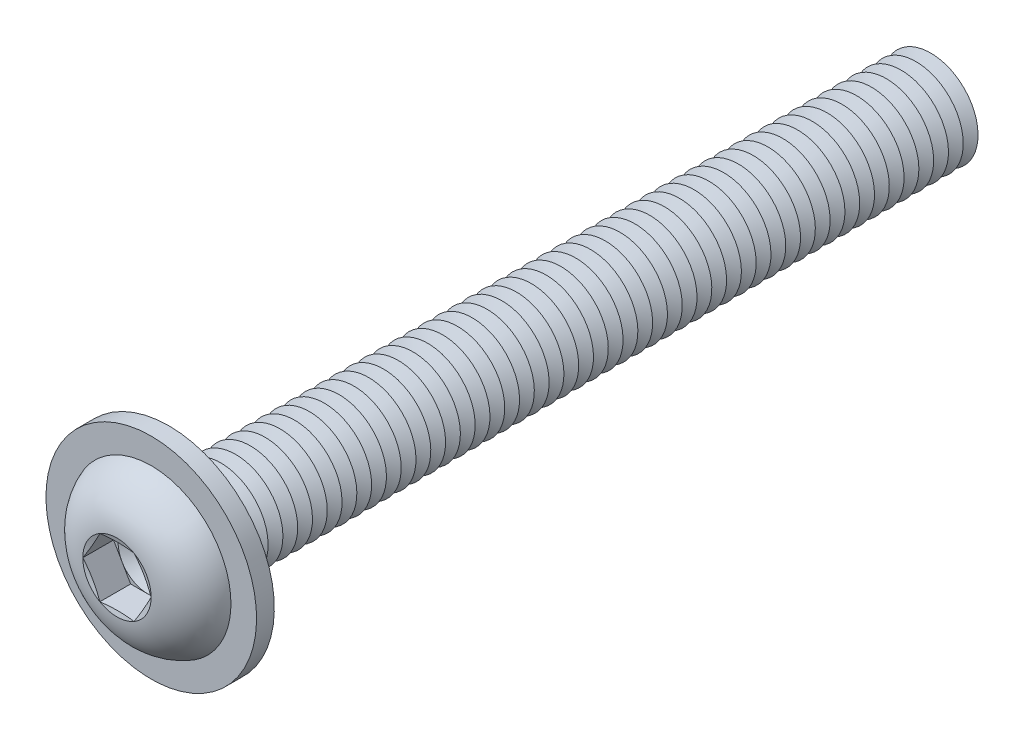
ISO-10303-21;
HEADER;
FILE_DESCRIPTION(('STEP AP214'),'2;1');
FILE_NAME('part.step','',(''),(''),'','','');
FILE_SCHEMA(('AUTOMOTIVE_DESIGN { 1 0 10303 214 1 1 1 1 }'));
ENDSEC;
DATA;
#1=APPLICATION_CONTEXT('core data for automotive mechanical design processes');
#2=APPLICATION_PROTOCOL_DEFINITION('international standard','automotive_design',2000,#1);
#3=PRODUCT_CONTEXT('',#1,'mechanical');
#4=PRODUCT('Part','Part','',(#3));
#5=PRODUCT_RELATED_PRODUCT_CATEGORY('part','',(#4));
#6=PRODUCT_DEFINITION_FORMATION('','',#4);
#7=PRODUCT_DEFINITION_CONTEXT('part definition',#1,'design');
#8=PRODUCT_DEFINITION('design','',#6,#7);
#9=PRODUCT_DEFINITION_SHAPE('','',#8);
#10=(LENGTH_UNIT() NAMED_UNIT(*) SI_UNIT(.MILLI.,.METRE.));
#11=(NAMED_UNIT(*) PLANE_ANGLE_UNIT() SI_UNIT($,.RADIAN.));
#12=(NAMED_UNIT(*) SI_UNIT($,.STERADIAN.) SOLID_ANGLE_UNIT());
#13=UNCERTAINTY_MEASURE_WITH_UNIT(LENGTH_MEASURE(1.E-05),#10,'distance_accuracy_value','');
#14=(GEOMETRIC_REPRESENTATION_CONTEXT(3) GLOBAL_UNCERTAINTY_ASSIGNED_CONTEXT((#13)) GLOBAL_UNIT_ASSIGNED_CONTEXT((#10,
#11,#12)) REPRESENTATION_CONTEXT('',''));
#15=CARTESIAN_POINT('',(0.,0.,0.));
#16=DIRECTION('',(0.,0.,1.));
#17=DIRECTION('',(1.,0.,0.));
#18=AXIS2_PLACEMENT_3D('',#15,#16,#17);
#19=CARTESIAN_POINT('',(0.,0.,-60.625));
#20=DIRECTION('',(0.,0.,1.));
#21=DIRECTION('',(0.,-1.,0.));
#22=AXIS2_PLACEMENT_3D('',#19,#20,#21);
#23=CONICAL_SURFACE('',#22,3.99999999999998,1.0471975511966);
#24=CARTESIAN_POINT('',(0.,0.,-61.25));
#25=DIRECTION('',(0.,0.,1.));
#26=DIRECTION('',(0.,-1.,0.));
#27=AXIS2_PLACEMENT_3D('',#24,#25,#26);
#28=CIRCLE('',#27,2.91746824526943);
#29=CARTESIAN_POINT('',(0.,-2.9174682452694,-61.25));
#30=VERTEX_POINT('',#29);
#31=EDGE_CURVE('E624',#30,#30,#28,.T.);
#32=ORIENTED_EDGE('',*,*,#31,.T.);
#33=EDGE_LOOP('',(#32));
#34=FACE_BOUND('',#33,.T.);
#35=CARTESIAN_POINT('',(0.,0.,-60.625));
#36=DIRECTION('',(0.,0.,1.));
#37=DIRECTION('',(0.,-1.,0.));
#38=AXIS2_PLACEMENT_3D('',#35,#36,#37);
#39=CIRCLE('',#38,3.99999999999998);
#40=CARTESIAN_POINT('',(0.,-3.99999999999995,-60.625));
#41=VERTEX_POINT('',#40);
#42=EDGE_CURVE('E620',#41,#41,#39,.T.);
#43=ORIENTED_EDGE('',*,*,#42,.F.);
#44=EDGE_LOOP('',(#43));
#45=FACE_BOUND('',#44,.T.);
#46=ADVANCED_FACE('F39',(#34,#45),#23,.T.);
#47=CARTESIAN_POINT('',(0.,0.,-61.25));
#48=DIRECTION('',(0.,0.,-1.));
#49=DIRECTION('',(0.,1.,0.));
#50=AXIS2_PLACEMENT_3D('',#47,#48,#49);
#51=CONICAL_SURFACE('',#50,2.91746824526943,1.0471975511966);
#52=CARTESIAN_POINT('',(0.,0.,-61.875));
#53=DIRECTION('',(0.,0.,1.));
#54=DIRECTION('',(0.,-1.,0.));
#55=AXIS2_PLACEMENT_3D('',#52,#53,#54);
#56=CIRCLE('',#55,3.99999999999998);
#57=CARTESIAN_POINT('',(0.,-3.99999999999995,-61.875));
#58=VERTEX_POINT('',#57);
#59=EDGE_CURVE('E628',#58,#58,#56,.T.);
#60=ORIENTED_EDGE('',*,*,#59,.T.);
#61=EDGE_LOOP('',(#60));
#62=FACE_BOUND('',#61,.T.);
#63=ORIENTED_EDGE('',*,*,#31,.F.);
#64=EDGE_LOOP('',(#63));
#65=FACE_BOUND('',#64,.T.);
#66=ADVANCED_FACE('F746',(#62,#65),#51,.T.);
#67=CARTESIAN_POINT('',(0.,3.99999999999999,-65.));
#68=DIRECTION('',(0.,0.,-1.));
#69=DIRECTION('',(0.,1.,0.));
#70=AXIS2_PLACEMENT_3D('',#67,#68,#69);
#71=PLANE('',#70);
#72=CARTESIAN_POINT('',(0.,0.,-65.));
#73=DIRECTION('',(0.,0.,1.));
#74=DIRECTION('',(0.,-1.,0.));
#75=AXIS2_PLACEMENT_3D('',#72,#73,#74);
#76=CIRCLE('',#75,2.91746824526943);
#77=CARTESIAN_POINT('',(0.,-2.9174682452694,-65.));
#78=VERTEX_POINT('',#77);
#79=EDGE_CURVE('E648',#78,#78,#76,.T.);
#80=ORIENTED_EDGE('',*,*,#79,.F.);
#81=EDGE_LOOP('',(#80));
#82=FACE_BOUND('',#81,.T.);
#83=ADVANCED_FACE('F752',(#82),#71,.T.);
#84=CARTESIAN_POINT('',(0.,0.,-64.375));
#85=DIRECTION('',(0.,0.,1.));
#86=DIRECTION('',(0.,-1.,0.));
#87=AXIS2_PLACEMENT_3D('',#84,#85,#86);
#88=CONICAL_SURFACE('',#87,3.99999999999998,1.0471975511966);
#89=ORIENTED_EDGE('',*,*,#79,.T.);
#90=EDGE_LOOP('',(#89));
#91=FACE_BOUND('',#90,.T.);
#92=CARTESIAN_POINT('',(0.,0.,-64.375));
#93=DIRECTION('',(0.,0.,1.));
#94=DIRECTION('',(0.,-1.,0.));
#95=AXIS2_PLACEMENT_3D('',#92,#93,#94);
#96=CIRCLE('',#95,3.99999999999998);
#97=CARTESIAN_POINT('',(0.,-3.99999999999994,-64.375));
#98=VERTEX_POINT('',#97);
#99=EDGE_CURVE('E644',#98,#98,#96,.T.);
#100=ORIENTED_EDGE('',*,*,#99,.F.);
#101=EDGE_LOOP('',(#100));
#102=FACE_BOUND('',#101,.T.);
#103=ADVANCED_FACE('F771',(#91,#102),#88,.T.);
#104=CARTESIAN_POINT('',(0.,0.,-63.75));
#105=DIRECTION('',(0.,0.,-1.));
#106=DIRECTION('',(0.,1.,0.));
#107=AXIS2_PLACEMENT_3D('',#104,#105,#106);
#108=CONICAL_SURFACE('',#107,2.91746824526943,1.0471975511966);
#109=ORIENTED_EDGE('',*,*,#99,.T.);
#110=EDGE_LOOP('',(#109));
#111=FACE_BOUND('',#110,.T.);
#112=CARTESIAN_POINT('',(0.,0.,-63.75));
#113=DIRECTION('',(0.,0.,1.));
#114=DIRECTION('',(0.,-1.,0.));
#115=AXIS2_PLACEMENT_3D('',#112,#113,#114);
#116=CIRCLE('',#115,2.91746824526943);
#117=CARTESIAN_POINT('',(0.,-2.9174682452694,-63.75));
#118=VERTEX_POINT('',#117);
#119=EDGE_CURVE('E640',#118,#118,#116,.T.);
#120=ORIENTED_EDGE('',*,*,#119,.F.);
#121=EDGE_LOOP('',(#120));
#122=FACE_BOUND('',#121,.T.);
#123=ADVANCED_FACE('F768',(#111,#122),#108,.T.);
#124=CARTESIAN_POINT('',(0.,0.,-63.125));
#125=DIRECTION('',(0.,0.,1.));
#126=DIRECTION('',(0.,-1.,0.));
#127=AXIS2_PLACEMENT_3D('',#124,#125,#126);
#128=CONICAL_SURFACE('',#127,3.99999999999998,1.0471975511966);
#129=ORIENTED_EDGE('',*,*,#119,.T.);
#130=EDGE_LOOP('',(#129));
#131=FACE_BOUND('',#130,.T.);
#132=CARTESIAN_POINT('',(0.,0.,-63.125));
#133=DIRECTION('',(0.,0.,1.));
#134=DIRECTION('',(0.,-1.,0.));
#135=AXIS2_PLACEMENT_3D('',#132,#133,#134);
#136=CIRCLE('',#135,3.99999999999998);
#137=CARTESIAN_POINT('',(0.,-3.99999999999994,-63.125));
#138=VERTEX_POINT('',#137);
#139=EDGE_CURVE('E636',#138,#138,#136,.T.);
#140=ORIENTED_EDGE('',*,*,#139,.F.);
#141=EDGE_LOOP('',(#140));
#142=FACE_BOUND('',#141,.T.);
#143=ADVANCED_FACE('F762',(#131,#142),#128,.T.);
#144=CARTESIAN_POINT('',(0.,0.,-62.5));
#145=DIRECTION('',(0.,0.,-1.));
#146=DIRECTION('',(0.,1.,0.));
#147=AXIS2_PLACEMENT_3D('',#144,#145,#146);
#148=CONICAL_SURFACE('',#147,2.91746824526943,1.0471975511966);
#149=ORIENTED_EDGE('',*,*,#139,.T.);
#150=EDGE_LOOP('',(#149));
#151=FACE_BOUND('',#150,.T.);
#152=CARTESIAN_POINT('',(0.,0.,-62.5));
#153=DIRECTION('',(0.,0.,1.));
#154=DIRECTION('',(0.,-1.,0.));
#155=AXIS2_PLACEMENT_3D('',#152,#153,#154);
#156=CIRCLE('',#155,2.91746824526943);
#157=CARTESIAN_POINT('',(0.,-2.9174682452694,-62.5));
#158=VERTEX_POINT('',#157);
#159=EDGE_CURVE('E632',#158,#158,#156,.T.);
#160=ORIENTED_EDGE('',*,*,#159,.F.);
#161=EDGE_LOOP('',(#160));
#162=FACE_BOUND('',#161,.T.);
#163=ADVANCED_FACE('F758',(#151,#162),#148,.T.);
#164=CARTESIAN_POINT('',(0.,0.,-61.875));
#165=DIRECTION('',(0.,0.,1.));
#166=DIRECTION('',(0.,-1.,0.));
#167=AXIS2_PLACEMENT_3D('',#164,#165,#166);
#168=CONICAL_SURFACE('',#167,3.99999999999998,1.0471975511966);
#169=ORIENTED_EDGE('',*,*,#159,.T.);
#170=EDGE_LOOP('',(#169));
#171=FACE_BOUND('',#170,.T.);
#172=ORIENTED_EDGE('',*,*,#59,.F.);
#173=EDGE_LOOP('',(#172));
#174=FACE_BOUND('',#173,.T.);
#175=ADVANCED_FACE('F761',(#171,#174),#168,.T.);
#176=CARTESIAN_POINT('',(0.,0.,-59.375));
#177=DIRECTION('',(0.,0.,1.));
#178=DIRECTION('',(0.,-1.,0.));
#179=AXIS2_PLACEMENT_3D('',#176,#177,#178);
#180=CONICAL_SURFACE('',#179,3.99999999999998,1.0471975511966);
#181=CARTESIAN_POINT('',(0.,0.,-60.));
#182=DIRECTION('',(0.,0.,1.));
#183=DIRECTION('',(0.,-1.,0.));
#184=AXIS2_PLACEMENT_3D('',#181,#182,#183);
#185=CIRCLE('',#184,2.91746824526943);
#186=CARTESIAN_POINT('',(0.,-2.9174682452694,-60.));
#187=VERTEX_POINT('',#186);
#188=EDGE_CURVE('E616',#187,#187,#185,.T.);
#189=ORIENTED_EDGE('',*,*,#188,.T.);
#190=EDGE_LOOP('',(#189));
#191=FACE_BOUND('',#190,.T.);
#192=CARTESIAN_POINT('',(0.,0.,-59.375));
#193=DIRECTION('',(0.,0.,1.));
#194=DIRECTION('',(0.,-1.,0.));
#195=AXIS2_PLACEMENT_3D('',#192,#193,#194);
#196=CIRCLE('',#195,3.99999999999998);
#197=CARTESIAN_POINT('',(0.,-3.99999999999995,-59.375));
#198=VERTEX_POINT('',#197);
#199=EDGE_CURVE('E612',#198,#198,#196,.T.);
#200=ORIENTED_EDGE('',*,*,#199,.F.);
#201=EDGE_LOOP('',(#200));
#202=FACE_BOUND('',#201,.T.);
#203=ADVANCED_FACE('F766',(#191,#202),#180,.T.);
#204=CARTESIAN_POINT('',(0.,0.,-60.));
#205=DIRECTION('',(0.,0.,-1.));
#206=DIRECTION('',(0.,1.,0.));
#207=AXIS2_PLACEMENT_3D('',#204,#205,#206);
#208=CONICAL_SURFACE('',#207,2.91746824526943,1.0471975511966);
#209=ORIENTED_EDGE('',*,*,#42,.T.);
#210=EDGE_LOOP('',(#209));
#211=FACE_BOUND('',#210,.T.);
#212=ORIENTED_EDGE('',*,*,#188,.F.);
#213=EDGE_LOOP('',(#212));
#214=FACE_BOUND('',#213,.T.);
#215=ADVANCED_FACE('F817',(#211,#214),#208,.T.);
#216=CARTESIAN_POINT('',(0.,0.,-58.125));
#217=DIRECTION('',(0.,0.,1.));
#218=DIRECTION('',(0.,-1.,0.));
#219=AXIS2_PLACEMENT_3D('',#216,#217,#218);
#220=CONICAL_SURFACE('',#219,3.99999999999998,1.0471975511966);
#221=CARTESIAN_POINT('',(0.,0.,-58.75));
#222=DIRECTION('',(0.,0.,1.));
#223=DIRECTION('',(0.,-1.,0.));
#224=AXIS2_PLACEMENT_3D('',#221,#222,#223);
#225=CIRCLE('',#224,2.91746824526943);
#226=CARTESIAN_POINT('',(0.,-2.9174682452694,-58.75));
#227=VERTEX_POINT('',#226);
#228=EDGE_CURVE('E608',#227,#227,#225,.T.);
#229=ORIENTED_EDGE('',*,*,#228,.T.);
#230=EDGE_LOOP('',(#229));
#231=FACE_BOUND('',#230,.T.);
#232=CARTESIAN_POINT('',(0.,0.,-58.125));
#233=DIRECTION('',(0.,0.,1.));
#234=DIRECTION('',(0.,-1.,0.));
#235=AXIS2_PLACEMENT_3D('',#232,#233,#234);
#236=CIRCLE('',#235,3.99999999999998);
#237=CARTESIAN_POINT('',(0.,-3.99999999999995,-58.125));
#238=VERTEX_POINT('',#237);
#239=EDGE_CURVE('E604',#238,#238,#236,.T.);
#240=ORIENTED_EDGE('',*,*,#239,.F.);
#241=EDGE_LOOP('',(#240));
#242=FACE_BOUND('',#241,.T.);
#243=ADVANCED_FACE('F823',(#231,#242),#220,.T.);
#244=CARTESIAN_POINT('',(0.,0.,-58.75));
#245=DIRECTION('',(0.,0.,-1.));
#246=DIRECTION('',(0.,1.,0.));
#247=AXIS2_PLACEMENT_3D('',#244,#245,#246);
#248=CONICAL_SURFACE('',#247,2.91746824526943,1.0471975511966);
#249=ORIENTED_EDGE('',*,*,#199,.T.);
#250=EDGE_LOOP('',(#249));
#251=FACE_BOUND('',#250,.T.);
#252=ORIENTED_EDGE('',*,*,#228,.F.);
#253=EDGE_LOOP('',(#252));
#254=FACE_BOUND('',#253,.T.);
#255=ADVANCED_FACE('F830',(#251,#254),#248,.T.);
#256=CARTESIAN_POINT('',(0.,0.,-56.875));
#257=DIRECTION('',(0.,0.,1.));
#258=DIRECTION('',(0.,-1.,0.));
#259=AXIS2_PLACEMENT_3D('',#256,#257,#258);
#260=CONICAL_SURFACE('',#259,3.99999999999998,1.0471975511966);
#261=CARTESIAN_POINT('',(0.,0.,-57.5));
#262=DIRECTION('',(0.,0.,1.));
#263=DIRECTION('',(0.,-1.,0.));
#264=AXIS2_PLACEMENT_3D('',#261,#262,#263);
#265=CIRCLE('',#264,2.91746824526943);
#266=CARTESIAN_POINT('',(0.,-2.9174682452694,-57.5));
#267=VERTEX_POINT('',#266);
#268=EDGE_CURVE('E600',#267,#267,#265,.T.);
#269=ORIENTED_EDGE('',*,*,#268,.T.);
#270=EDGE_LOOP('',(#269));
#271=FACE_BOUND('',#270,.T.);
#272=CARTESIAN_POINT('',(0.,0.,-56.875));
#273=DIRECTION('',(0.,0.,1.));
#274=DIRECTION('',(0.,-1.,0.));
#275=AXIS2_PLACEMENT_3D('',#272,#273,#274);
#276=CIRCLE('',#275,3.99999999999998);
#277=CARTESIAN_POINT('',(0.,-3.99999999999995,-56.875));
#278=VERTEX_POINT('',#277);
#279=EDGE_CURVE('E596',#278,#278,#276,.T.);
#280=ORIENTED_EDGE('',*,*,#279,.F.);
#281=EDGE_LOOP('',(#280));
#282=FACE_BOUND('',#281,.T.);
#283=ADVANCED_FACE('F837',(#271,#282),#260,.T.);
#284=CARTESIAN_POINT('',(0.,0.,-57.5));
#285=DIRECTION('',(0.,0.,-1.));
#286=DIRECTION('',(0.,1.,0.));
#287=AXIS2_PLACEMENT_3D('',#284,#285,#286);
#288=CONICAL_SURFACE('',#287,2.91746824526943,1.0471975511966);
#289=ORIENTED_EDGE('',*,*,#239,.T.);
#290=EDGE_LOOP('',(#289));
#291=FACE_BOUND('',#290,.T.);
#292=ORIENTED_EDGE('',*,*,#268,.F.);
#293=EDGE_LOOP('',(#292));
#294=FACE_BOUND('',#293,.T.);
#295=ADVANCED_FACE('F844',(#291,#294),#288,.T.);
#296=CARTESIAN_POINT('',(0.,0.,-55.625));
#297=DIRECTION('',(0.,0.,1.));
#298=DIRECTION('',(0.,-1.,0.));
#299=AXIS2_PLACEMENT_3D('',#296,#297,#298);
#300=CONICAL_SURFACE('',#299,3.99999999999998,1.0471975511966);
#301=CARTESIAN_POINT('',(0.,0.,-56.25));
#302=DIRECTION('',(0.,0.,1.));
#303=DIRECTION('',(0.,-1.,0.));
#304=AXIS2_PLACEMENT_3D('',#301,#302,#303);
#305=CIRCLE('',#304,2.91746824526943);
#306=CARTESIAN_POINT('',(0.,-2.9174682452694,-56.25));
#307=VERTEX_POINT('',#306);
#308=EDGE_CURVE('E592',#307,#307,#305,.T.);
#309=ORIENTED_EDGE('',*,*,#308,.T.);
#310=EDGE_LOOP('',(#309));
#311=FACE_BOUND('',#310,.T.);
#312=CARTESIAN_POINT('',(0.,0.,-55.625));
#313=DIRECTION('',(0.,0.,1.));
#314=DIRECTION('',(0.,-1.,0.));
#315=AXIS2_PLACEMENT_3D('',#312,#313,#314);
#316=CIRCLE('',#315,3.99999999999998);
#317=CARTESIAN_POINT('',(0.,-3.99999999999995,-55.625));
#318=VERTEX_POINT('',#317);
#319=EDGE_CURVE('E588',#318,#318,#316,.T.);
#320=ORIENTED_EDGE('',*,*,#319,.F.);
#321=EDGE_LOOP('',(#320));
#322=FACE_BOUND('',#321,.T.);
#323=ADVANCED_FACE('F851',(#311,#322),#300,.T.);
#324=CARTESIAN_POINT('',(0.,0.,-56.25));
#325=DIRECTION('',(0.,0.,-1.));
#326=DIRECTION('',(0.,1.,0.));
#327=AXIS2_PLACEMENT_3D('',#324,#325,#326);
#328=CONICAL_SURFACE('',#327,2.91746824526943,1.0471975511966);
#329=ORIENTED_EDGE('',*,*,#279,.T.);
#330=EDGE_LOOP('',(#329));
#331=FACE_BOUND('',#330,.T.);
#332=ORIENTED_EDGE('',*,*,#308,.F.);
#333=EDGE_LOOP('',(#332));
#334=FACE_BOUND('',#333,.T.);
#335=ADVANCED_FACE('F858',(#331,#334),#328,.T.);
#336=CARTESIAN_POINT('',(0.,0.,-54.375));
#337=DIRECTION('',(0.,0.,1.));
#338=DIRECTION('',(0.,-1.,0.));
#339=AXIS2_PLACEMENT_3D('',#336,#337,#338);
#340=CONICAL_SURFACE('',#339,3.99999999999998,1.0471975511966);
#341=CARTESIAN_POINT('',(0.,0.,-55.));
#342=DIRECTION('',(0.,0.,1.));
#343=DIRECTION('',(0.,-1.,0.));
#344=AXIS2_PLACEMENT_3D('',#341,#342,#343);
#345=CIRCLE('',#344,2.91746824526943);
#346=CARTESIAN_POINT('',(0.,-2.9174682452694,-55.));
#347=VERTEX_POINT('',#346);
#348=EDGE_CURVE('E584',#347,#347,#345,.T.);
#349=ORIENTED_EDGE('',*,*,#348,.T.);
#350=EDGE_LOOP('',(#349));
#351=FACE_BOUND('',#350,.T.);
#352=CARTESIAN_POINT('',(0.,0.,-54.375));
#353=DIRECTION('',(0.,0.,1.));
#354=DIRECTION('',(0.,-1.,0.));
#355=AXIS2_PLACEMENT_3D('',#352,#353,#354);
#356=CIRCLE('',#355,3.99999999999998);
#357=CARTESIAN_POINT('',(0.,-3.99999999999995,-54.375));
#358=VERTEX_POINT('',#357);
#359=EDGE_CURVE('E580',#358,#358,#356,.T.);
#360=ORIENTED_EDGE('',*,*,#359,.F.);
#361=EDGE_LOOP('',(#360));
#362=FACE_BOUND('',#361,.T.);
#363=ADVANCED_FACE('F865',(#351,#362),#340,.T.);
#364=CARTESIAN_POINT('',(0.,0.,-55.));
#365=DIRECTION('',(0.,0.,-1.));
#366=DIRECTION('',(0.,1.,0.));
#367=AXIS2_PLACEMENT_3D('',#364,#365,#366);
#368=CONICAL_SURFACE('',#367,2.91746824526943,1.0471975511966);
#369=ORIENTED_EDGE('',*,*,#319,.T.);
#370=EDGE_LOOP('',(#369));
#371=FACE_BOUND('',#370,.T.);
#372=ORIENTED_EDGE('',*,*,#348,.F.);
#373=EDGE_LOOP('',(#372));
#374=FACE_BOUND('',#373,.T.);
#375=ADVANCED_FACE('F872',(#371,#374),#368,.T.);
#376=CARTESIAN_POINT('',(0.,0.,-53.125));
#377=DIRECTION('',(0.,0.,1.));
#378=DIRECTION('',(0.,-1.,0.));
#379=AXIS2_PLACEMENT_3D('',#376,#377,#378);
#380=CONICAL_SURFACE('',#379,3.99999999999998,1.0471975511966);
#381=CARTESIAN_POINT('',(0.,0.,-53.75));
#382=DIRECTION('',(0.,0.,1.));
#383=DIRECTION('',(0.,-1.,0.));
#384=AXIS2_PLACEMENT_3D('',#381,#382,#383);
#385=CIRCLE('',#384,2.91746824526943);
#386=CARTESIAN_POINT('',(0.,-2.9174682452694,-53.75));
#387=VERTEX_POINT('',#386);
#388=EDGE_CURVE('E576',#387,#387,#385,.T.);
#389=ORIENTED_EDGE('',*,*,#388,.T.);
#390=EDGE_LOOP('',(#389));
#391=FACE_BOUND('',#390,.T.);
#392=CARTESIAN_POINT('',(0.,0.,-53.125));
#393=DIRECTION('',(0.,0.,1.));
#394=DIRECTION('',(0.,-1.,0.));
#395=AXIS2_PLACEMENT_3D('',#392,#393,#394);
#396=CIRCLE('',#395,3.99999999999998);
#397=CARTESIAN_POINT('',(0.,-3.99999999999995,-53.125));
#398=VERTEX_POINT('',#397);
#399=EDGE_CURVE('E572',#398,#398,#396,.T.);
#400=ORIENTED_EDGE('',*,*,#399,.F.);
#401=EDGE_LOOP('',(#400));
#402=FACE_BOUND('',#401,.T.);
#403=ADVANCED_FACE('F879',(#391,#402),#380,.T.);
#404=CARTESIAN_POINT('',(0.,0.,-53.75));
#405=DIRECTION('',(0.,0.,-1.));
#406=DIRECTION('',(0.,1.,0.));
#407=AXIS2_PLACEMENT_3D('',#404,#405,#406);
#408=CONICAL_SURFACE('',#407,2.91746824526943,1.0471975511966);
#409=ORIENTED_EDGE('',*,*,#359,.T.);
#410=EDGE_LOOP('',(#409));
#411=FACE_BOUND('',#410,.T.);
#412=ORIENTED_EDGE('',*,*,#388,.F.);
#413=EDGE_LOOP('',(#412));
#414=FACE_BOUND('',#413,.T.);
#415=ADVANCED_FACE('F886',(#411,#414),#408,.T.);
#416=CARTESIAN_POINT('',(0.,0.,-51.875));
#417=DIRECTION('',(0.,0.,1.));
#418=DIRECTION('',(0.,-1.,0.));
#419=AXIS2_PLACEMENT_3D('',#416,#417,#418);
#420=CONICAL_SURFACE('',#419,3.99999999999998,1.0471975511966);
#421=CARTESIAN_POINT('',(0.,0.,-52.5));
#422=DIRECTION('',(0.,0.,1.));
#423=DIRECTION('',(0.,-1.,0.));
#424=AXIS2_PLACEMENT_3D('',#421,#422,#423);
#425=CIRCLE('',#424,2.91746824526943);
#426=CARTESIAN_POINT('',(0.,-2.9174682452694,-52.5));
#427=VERTEX_POINT('',#426);
#428=EDGE_CURVE('E568',#427,#427,#425,.T.);
#429=ORIENTED_EDGE('',*,*,#428,.T.);
#430=EDGE_LOOP('',(#429));
#431=FACE_BOUND('',#430,.T.);
#432=CARTESIAN_POINT('',(0.,0.,-51.875));
#433=DIRECTION('',(0.,0.,1.));
#434=DIRECTION('',(0.,-1.,0.));
#435=AXIS2_PLACEMENT_3D('',#432,#433,#434);
#436=CIRCLE('',#435,3.99999999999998);
#437=CARTESIAN_POINT('',(0.,-3.99999999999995,-51.875));
#438=VERTEX_POINT('',#437);
#439=EDGE_CURVE('E564',#438,#438,#436,.T.);
#440=ORIENTED_EDGE('',*,*,#439,.F.);
#441=EDGE_LOOP('',(#440));
#442=FACE_BOUND('',#441,.T.);
#443=ADVANCED_FACE('F893',(#431,#442),#420,.T.);
#444=CARTESIAN_POINT('',(0.,0.,-52.5));
#445=DIRECTION('',(0.,0.,-1.));
#446=DIRECTION('',(0.,1.,0.));
#447=AXIS2_PLACEMENT_3D('',#444,#445,#446);
#448=CONICAL_SURFACE('',#447,2.91746824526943,1.0471975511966);
#449=ORIENTED_EDGE('',*,*,#399,.T.);
#450=EDGE_LOOP('',(#449));
#451=FACE_BOUND('',#450,.T.);
#452=ORIENTED_EDGE('',*,*,#428,.F.);
#453=EDGE_LOOP('',(#452));
#454=FACE_BOUND('',#453,.T.);
#455=ADVANCED_FACE('F900',(#451,#454),#448,.T.);
#456=CARTESIAN_POINT('',(0.,0.,-50.625));
#457=DIRECTION('',(0.,0.,1.));
#458=DIRECTION('',(0.,-1.,0.));
#459=AXIS2_PLACEMENT_3D('',#456,#457,#458);
#460=CONICAL_SURFACE('',#459,3.99999999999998,1.0471975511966);
#461=CARTESIAN_POINT('',(0.,0.,-51.25));
#462=DIRECTION('',(0.,0.,1.));
#463=DIRECTION('',(0.,-1.,0.));
#464=AXIS2_PLACEMENT_3D('',#461,#462,#463);
#465=CIRCLE('',#464,2.91746824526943);
#466=CARTESIAN_POINT('',(0.,-2.9174682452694,-51.25));
#467=VERTEX_POINT('',#466);
#468=EDGE_CURVE('E560',#467,#467,#465,.T.);
#469=ORIENTED_EDGE('',*,*,#468,.T.);
#470=EDGE_LOOP('',(#469));
#471=FACE_BOUND('',#470,.T.);
#472=CARTESIAN_POINT('',(0.,0.,-50.625));
#473=DIRECTION('',(0.,0.,1.));
#474=DIRECTION('',(0.,-1.,0.));
#475=AXIS2_PLACEMENT_3D('',#472,#473,#474);
#476=CIRCLE('',#475,3.99999999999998);
#477=CARTESIAN_POINT('',(0.,-3.99999999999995,-50.625));
#478=VERTEX_POINT('',#477);
#479=EDGE_CURVE('E556',#478,#478,#476,.T.);
#480=ORIENTED_EDGE('',*,*,#479,.F.);
#481=EDGE_LOOP('',(#480));
#482=FACE_BOUND('',#481,.T.);
#483=ADVANCED_FACE('F907',(#471,#482),#460,.T.);
#484=CARTESIAN_POINT('',(0.,0.,-51.25));
#485=DIRECTION('',(0.,0.,-1.));
#486=DIRECTION('',(0.,1.,0.));
#487=AXIS2_PLACEMENT_3D('',#484,#485,#486);
#488=CONICAL_SURFACE('',#487,2.91746824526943,1.0471975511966);
#489=ORIENTED_EDGE('',*,*,#439,.T.);
#490=EDGE_LOOP('',(#489));
#491=FACE_BOUND('',#490,.T.);
#492=ORIENTED_EDGE('',*,*,#468,.F.);
#493=EDGE_LOOP('',(#492));
#494=FACE_BOUND('',#493,.T.);
#495=ADVANCED_FACE('F914',(#491,#494),#488,.T.);
#496=CARTESIAN_POINT('',(0.,0.,-49.375));
#497=DIRECTION('',(0.,0.,1.));
#498=DIRECTION('',(0.,-1.,0.));
#499=AXIS2_PLACEMENT_3D('',#496,#497,#498);
#500=CONICAL_SURFACE('',#499,3.99999999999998,1.0471975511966);
#501=CARTESIAN_POINT('',(0.,0.,-50.));
#502=DIRECTION('',(0.,0.,1.));
#503=DIRECTION('',(0.,-1.,0.));
#504=AXIS2_PLACEMENT_3D('',#501,#502,#503);
#505=CIRCLE('',#504,2.91746824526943);
#506=CARTESIAN_POINT('',(0.,-2.9174682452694,-50.));
#507=VERTEX_POINT('',#506);
#508=EDGE_CURVE('E553',#507,#507,#505,.T.);
#509=ORIENTED_EDGE('',*,*,#508,.T.);
#510=EDGE_LOOP('',(#509));
#511=FACE_BOUND('',#510,.T.);
#512=CARTESIAN_POINT('',(0.,0.,-49.375));
#513=DIRECTION('',(0.,0.,1.));
#514=DIRECTION('',(0.,-1.,0.));
#515=AXIS2_PLACEMENT_3D('',#512,#513,#514);
#516=CIRCLE('',#515,3.99999999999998);
#517=CARTESIAN_POINT('',(0.,-3.99999999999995,-49.375));
#518=VERTEX_POINT('',#517);
#519=EDGE_CURVE('E549',#518,#518,#516,.T.);
#520=ORIENTED_EDGE('',*,*,#519,.F.);
#521=EDGE_LOOP('',(#520));
#522=FACE_BOUND('',#521,.T.);
#523=ADVANCED_FACE('F921',(#511,#522),#500,.T.);
#524=CARTESIAN_POINT('',(0.,0.,-50.));
#525=DIRECTION('',(0.,0.,-1.));
#526=DIRECTION('',(0.,1.,0.));
#527=AXIS2_PLACEMENT_3D('',#524,#525,#526);
#528=CONICAL_SURFACE('',#527,2.91746824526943,1.0471975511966);
#529=ORIENTED_EDGE('',*,*,#479,.T.);
#530=EDGE_LOOP('',(#529));
#531=FACE_BOUND('',#530,.T.);
#532=ORIENTED_EDGE('',*,*,#508,.F.);
#533=EDGE_LOOP('',(#532));
#534=FACE_BOUND('',#533,.T.);
#535=ADVANCED_FACE('F928',(#531,#534),#528,.T.);
#536=CARTESIAN_POINT('',(0.,0.,-48.125));
#537=DIRECTION('',(0.,0.,1.));
#538=DIRECTION('',(0.,-1.,0.));
#539=AXIS2_PLACEMENT_3D('',#536,#537,#538);
#540=CONICAL_SURFACE('',#539,3.99999999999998,1.0471975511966);
#541=CARTESIAN_POINT('',(0.,0.,-48.75));
#542=DIRECTION('',(0.,0.,1.));
#543=DIRECTION('',(0.,-1.,0.));
#544=AXIS2_PLACEMENT_3D('',#541,#542,#543);
#545=CIRCLE('',#544,2.91746824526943);
#546=CARTESIAN_POINT('',(0.,-2.9174682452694,-48.75));
#547=VERTEX_POINT('',#546);
#548=EDGE_CURVE('E545',#547,#547,#545,.T.);
#549=ORIENTED_EDGE('',*,*,#548,.T.);
#550=EDGE_LOOP('',(#549));
#551=FACE_BOUND('',#550,.T.);
#552=CARTESIAN_POINT('',(0.,0.,-48.125));
#553=DIRECTION('',(0.,0.,1.));
#554=DIRECTION('',(0.,-1.,0.));
#555=AXIS2_PLACEMENT_3D('',#552,#553,#554);
#556=CIRCLE('',#555,3.99999999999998);
#557=CARTESIAN_POINT('',(0.,-3.99999999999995,-48.125));
#558=VERTEX_POINT('',#557);
#559=EDGE_CURVE('E541',#558,#558,#556,.T.);
#560=ORIENTED_EDGE('',*,*,#559,.F.);
#561=EDGE_LOOP('',(#560));
#562=FACE_BOUND('',#561,.T.);
#563=ADVANCED_FACE('F935',(#551,#562),#540,.T.);
#564=CARTESIAN_POINT('',(0.,0.,-48.75));
#565=DIRECTION('',(0.,0.,-1.));
#566=DIRECTION('',(0.,1.,0.));
#567=AXIS2_PLACEMENT_3D('',#564,#565,#566);
#568=CONICAL_SURFACE('',#567,2.91746824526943,1.0471975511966);
#569=ORIENTED_EDGE('',*,*,#519,.T.);
#570=EDGE_LOOP('',(#569));
#571=FACE_BOUND('',#570,.T.);
#572=ORIENTED_EDGE('',*,*,#548,.F.);
#573=EDGE_LOOP('',(#572));
#574=FACE_BOUND('',#573,.T.);
#575=ADVANCED_FACE('F942',(#571,#574),#568,.T.);
#576=CARTESIAN_POINT('',(0.,0.,-46.875));
#577=DIRECTION('',(0.,0.,1.));
#578=DIRECTION('',(0.,-1.,0.));
#579=AXIS2_PLACEMENT_3D('',#576,#577,#578);
#580=CONICAL_SURFACE('',#579,3.99999999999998,1.0471975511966);
#581=CARTESIAN_POINT('',(0.,0.,-47.5));
#582=DIRECTION('',(0.,0.,1.));
#583=DIRECTION('',(0.,-1.,0.));
#584=AXIS2_PLACEMENT_3D('',#581,#582,#583);
#585=CIRCLE('',#584,2.91746824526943);
#586=CARTESIAN_POINT('',(0.,-2.9174682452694,-47.5));
#587=VERTEX_POINT('',#586);
#588=EDGE_CURVE('E537',#587,#587,#585,.T.);
#589=ORIENTED_EDGE('',*,*,#588,.T.);
#590=EDGE_LOOP('',(#589));
#591=FACE_BOUND('',#590,.T.);
#592=CARTESIAN_POINT('',(0.,0.,-46.875));
#593=DIRECTION('',(0.,0.,1.));
#594=DIRECTION('',(0.,-1.,0.));
#595=AXIS2_PLACEMENT_3D('',#592,#593,#594);
#596=CIRCLE('',#595,3.99999999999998);
#597=CARTESIAN_POINT('',(0.,-3.99999999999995,-46.875));
#598=VERTEX_POINT('',#597);
#599=EDGE_CURVE('E533',#598,#598,#596,.T.);
#600=ORIENTED_EDGE('',*,*,#599,.F.);
#601=EDGE_LOOP('',(#600));
#602=FACE_BOUND('',#601,.T.);
#603=ADVANCED_FACE('F949',(#591,#602),#580,.T.);
#604=CARTESIAN_POINT('',(0.,0.,-47.5));
#605=DIRECTION('',(0.,0.,-1.));
#606=DIRECTION('',(0.,1.,0.));
#607=AXIS2_PLACEMENT_3D('',#604,#605,#606);
#608=CONICAL_SURFACE('',#607,2.91746824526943,1.0471975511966);
#609=ORIENTED_EDGE('',*,*,#559,.T.);
#610=EDGE_LOOP('',(#609));
#611=FACE_BOUND('',#610,.T.);
#612=ORIENTED_EDGE('',*,*,#588,.F.);
#613=EDGE_LOOP('',(#612));
#614=FACE_BOUND('',#613,.T.);
#615=ADVANCED_FACE('F956',(#611,#614),#608,.T.);
#616=CARTESIAN_POINT('',(0.,0.,-45.625));
#617=DIRECTION('',(0.,0.,1.));
#618=DIRECTION('',(0.,-1.,0.));
#619=AXIS2_PLACEMENT_3D('',#616,#617,#618);
#620=CONICAL_SURFACE('',#619,3.99999999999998,1.0471975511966);
#621=CARTESIAN_POINT('',(0.,0.,-46.25));
#622=DIRECTION('',(0.,0.,1.));
#623=DIRECTION('',(0.,-1.,0.));
#624=AXIS2_PLACEMENT_3D('',#621,#622,#623);
#625=CIRCLE('',#624,2.91746824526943);
#626=CARTESIAN_POINT('',(0.,-2.9174682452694,-46.25));
#627=VERTEX_POINT('',#626);
#628=EDGE_CURVE('E529',#627,#627,#625,.T.);
#629=ORIENTED_EDGE('',*,*,#628,.T.);
#630=EDGE_LOOP('',(#629));
#631=FACE_BOUND('',#630,.T.);
#632=CARTESIAN_POINT('',(0.,0.,-45.625));
#633=DIRECTION('',(0.,0.,1.));
#634=DIRECTION('',(0.,-1.,0.));
#635=AXIS2_PLACEMENT_3D('',#632,#633,#634);
#636=CIRCLE('',#635,3.99999999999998);
#637=CARTESIAN_POINT('',(0.,-3.99999999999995,-45.625));
#638=VERTEX_POINT('',#637);
#639=EDGE_CURVE('E525',#638,#638,#636,.T.);
#640=ORIENTED_EDGE('',*,*,#639,.F.);
#641=EDGE_LOOP('',(#640));
#642=FACE_BOUND('',#641,.T.);
#643=ADVANCED_FACE('F963',(#631,#642),#620,.T.);
#644=CARTESIAN_POINT('',(0.,0.,-46.25));
#645=DIRECTION('',(0.,0.,-1.));
#646=DIRECTION('',(0.,1.,0.));
#647=AXIS2_PLACEMENT_3D('',#644,#645,#646);
#648=CONICAL_SURFACE('',#647,2.91746824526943,1.0471975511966);
#649=ORIENTED_EDGE('',*,*,#599,.T.);
#650=EDGE_LOOP('',(#649));
#651=FACE_BOUND('',#650,.T.);
#652=ORIENTED_EDGE('',*,*,#628,.F.);
#653=EDGE_LOOP('',(#652));
#654=FACE_BOUND('',#653,.T.);
#655=ADVANCED_FACE('F970',(#651,#654),#648,.T.);
#656=CARTESIAN_POINT('',(0.,0.,-44.375));
#657=DIRECTION('',(0.,0.,1.));
#658=DIRECTION('',(0.,-1.,0.));
#659=AXIS2_PLACEMENT_3D('',#656,#657,#658);
#660=CONICAL_SURFACE('',#659,3.99999999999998,1.0471975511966);
#661=CARTESIAN_POINT('',(0.,0.,-45.));
#662=DIRECTION('',(0.,0.,1.));
#663=DIRECTION('',(0.,-1.,0.));
#664=AXIS2_PLACEMENT_3D('',#661,#662,#663);
#665=CIRCLE('',#664,2.91746824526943);
#666=CARTESIAN_POINT('',(0.,-2.91746824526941,-45.));
#667=VERTEX_POINT('',#666);
#668=EDGE_CURVE('E521',#667,#667,#665,.T.);
#669=ORIENTED_EDGE('',*,*,#668,.T.);
#670=EDGE_LOOP('',(#669));
#671=FACE_BOUND('',#670,.T.);
#672=CARTESIAN_POINT('',(0.,0.,-44.375));
#673=DIRECTION('',(0.,0.,1.));
#674=DIRECTION('',(0.,-1.,0.));
#675=AXIS2_PLACEMENT_3D('',#672,#673,#674);
#676=CIRCLE('',#675,3.99999999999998);
#677=CARTESIAN_POINT('',(0.,-3.99999999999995,-44.375));
#678=VERTEX_POINT('',#677);
#679=EDGE_CURVE('E517',#678,#678,#676,.T.);
#680=ORIENTED_EDGE('',*,*,#679,.F.);
#681=EDGE_LOOP('',(#680));
#682=FACE_BOUND('',#681,.T.);
#683=ADVANCED_FACE('F977',(#671,#682),#660,.T.);
#684=CARTESIAN_POINT('',(0.,0.,-45.));
#685=DIRECTION('',(0.,0.,-1.));
#686=DIRECTION('',(0.,1.,0.));
#687=AXIS2_PLACEMENT_3D('',#684,#685,#686);
#688=CONICAL_SURFACE('',#687,2.91746824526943,1.0471975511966);
#689=ORIENTED_EDGE('',*,*,#639,.T.);
#690=EDGE_LOOP('',(#689));
#691=FACE_BOUND('',#690,.T.);
#692=ORIENTED_EDGE('',*,*,#668,.F.);
#693=EDGE_LOOP('',(#692));
#694=FACE_BOUND('',#693,.T.);
#695=ADVANCED_FACE('F984',(#691,#694),#688,.T.);
#696=CARTESIAN_POINT('',(0.,0.,-43.125));
#697=DIRECTION('',(0.,0.,1.));
#698=DIRECTION('',(0.,-1.,0.));
#699=AXIS2_PLACEMENT_3D('',#696,#697,#698);
#700=CONICAL_SURFACE('',#699,3.99999999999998,1.0471975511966);
#701=CARTESIAN_POINT('',(0.,0.,-43.75));
#702=DIRECTION('',(0.,0.,1.));
#703=DIRECTION('',(0.,-1.,0.));
#704=AXIS2_PLACEMENT_3D('',#701,#702,#703);
#705=CIRCLE('',#704,2.91746824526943);
#706=CARTESIAN_POINT('',(0.,-2.91746824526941,-43.75));
#707=VERTEX_POINT('',#706);
#708=EDGE_CURVE('E513',#707,#707,#705,.T.);
#709=ORIENTED_EDGE('',*,*,#708,.T.);
#710=EDGE_LOOP('',(#709));
#711=FACE_BOUND('',#710,.T.);
#712=CARTESIAN_POINT('',(0.,0.,-43.125));
#713=DIRECTION('',(0.,0.,1.));
#714=DIRECTION('',(0.,-1.,0.));
#715=AXIS2_PLACEMENT_3D('',#712,#713,#714);
#716=CIRCLE('',#715,3.99999999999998);
#717=CARTESIAN_POINT('',(0.,-3.99999999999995,-43.125));
#718=VERTEX_POINT('',#717);
#719=EDGE_CURVE('E509',#718,#718,#716,.T.);
#720=ORIENTED_EDGE('',*,*,#719,.F.);
#721=EDGE_LOOP('',(#720));
#722=FACE_BOUND('',#721,.T.);
#723=ADVANCED_FACE('F991',(#711,#722),#700,.T.);
#724=CARTESIAN_POINT('',(0.,0.,-43.75));
#725=DIRECTION('',(0.,0.,-1.));
#726=DIRECTION('',(0.,1.,0.));
#727=AXIS2_PLACEMENT_3D('',#724,#725,#726);
#728=CONICAL_SURFACE('',#727,2.91746824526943,1.0471975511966);
#729=ORIENTED_EDGE('',*,*,#679,.T.);
#730=EDGE_LOOP('',(#729));
#731=FACE_BOUND('',#730,.T.);
#732=ORIENTED_EDGE('',*,*,#708,.F.);
#733=EDGE_LOOP('',(#732));
#734=FACE_BOUND('',#733,.T.);
#735=ADVANCED_FACE('F998',(#731,#734),#728,.T.);
#736=CARTESIAN_POINT('',(0.,0.,-41.875));
#737=DIRECTION('',(0.,0.,1.));
#738=DIRECTION('',(0.,-1.,0.));
#739=AXIS2_PLACEMENT_3D('',#736,#737,#738);
#740=CONICAL_SURFACE('',#739,3.99999999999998,1.0471975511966);
#741=CARTESIAN_POINT('',(0.,0.,-42.5));
#742=DIRECTION('',(0.,0.,1.));
#743=DIRECTION('',(0.,-1.,0.));
#744=AXIS2_PLACEMENT_3D('',#741,#742,#743);
#745=CIRCLE('',#744,2.91746824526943);
#746=CARTESIAN_POINT('',(0.,-2.91746824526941,-42.5));
#747=VERTEX_POINT('',#746);
#748=EDGE_CURVE('E505',#747,#747,#745,.T.);
#749=ORIENTED_EDGE('',*,*,#748,.T.);
#750=EDGE_LOOP('',(#749));
#751=FACE_BOUND('',#750,.T.);
#752=CARTESIAN_POINT('',(0.,0.,-41.875));
#753=DIRECTION('',(0.,0.,1.));
#754=DIRECTION('',(0.,-1.,0.));
#755=AXIS2_PLACEMENT_3D('',#752,#753,#754);
#756=CIRCLE('',#755,3.99999999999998);
#757=CARTESIAN_POINT('',(0.,-3.99999999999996,-41.875));
#758=VERTEX_POINT('',#757);
#759=EDGE_CURVE('E501',#758,#758,#756,.T.);
#760=ORIENTED_EDGE('',*,*,#759,.F.);
#761=EDGE_LOOP('',(#760));
#762=FACE_BOUND('',#761,.T.);
#763=ADVANCED_FACE('F1005',(#751,#762),#740,.T.);
#764=CARTESIAN_POINT('',(0.,0.,-42.5));
#765=DIRECTION('',(0.,0.,-1.));
#766=DIRECTION('',(0.,1.,0.));
#767=AXIS2_PLACEMENT_3D('',#764,#765,#766);
#768=CONICAL_SURFACE('',#767,2.91746824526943,1.0471975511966);
#769=ORIENTED_EDGE('',*,*,#719,.T.);
#770=EDGE_LOOP('',(#769));
#771=FACE_BOUND('',#770,.T.);
#772=ORIENTED_EDGE('',*,*,#748,.F.);
#773=EDGE_LOOP('',(#772));
#774=FACE_BOUND('',#773,.T.);
#775=ADVANCED_FACE('F1012',(#771,#774),#768,.T.);
#776=CARTESIAN_POINT('',(0.,0.,-40.625));
#777=DIRECTION('',(0.,0.,1.));
#778=DIRECTION('',(0.,-1.,0.));
#779=AXIS2_PLACEMENT_3D('',#776,#777,#778);
#780=CONICAL_SURFACE('',#779,3.99999999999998,1.0471975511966);
#781=CARTESIAN_POINT('',(0.,0.,-41.25));
#782=DIRECTION('',(0.,0.,1.));
#783=DIRECTION('',(0.,-1.,0.));
#784=AXIS2_PLACEMENT_3D('',#781,#782,#783);
#785=CIRCLE('',#784,2.91746824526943);
#786=CARTESIAN_POINT('',(0.,-2.91746824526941,-41.25));
#787=VERTEX_POINT('',#786);
#788=EDGE_CURVE('E497',#787,#787,#785,.T.);
#789=ORIENTED_EDGE('',*,*,#788,.T.);
#790=EDGE_LOOP('',(#789));
#791=FACE_BOUND('',#790,.T.);
#792=CARTESIAN_POINT('',(0.,0.,-40.625));
#793=DIRECTION('',(0.,0.,1.));
#794=DIRECTION('',(0.,-1.,0.));
#795=AXIS2_PLACEMENT_3D('',#792,#793,#794);
#796=CIRCLE('',#795,3.99999999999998);
#797=CARTESIAN_POINT('',(0.,-3.99999999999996,-40.625));
#798=VERTEX_POINT('',#797);
#799=EDGE_CURVE('E493',#798,#798,#796,.T.);
#800=ORIENTED_EDGE('',*,*,#799,.F.);
#801=EDGE_LOOP('',(#800));
#802=FACE_BOUND('',#801,.T.);
#803=ADVANCED_FACE('F1019',(#791,#802),#780,.T.);
#804=CARTESIAN_POINT('',(0.,0.,-41.25));
#805=DIRECTION('',(0.,0.,-1.));
#806=DIRECTION('',(0.,1.,0.));
#807=AXIS2_PLACEMENT_3D('',#804,#805,#806);
#808=CONICAL_SURFACE('',#807,2.91746824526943,1.0471975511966);
#809=ORIENTED_EDGE('',*,*,#759,.T.);
#810=EDGE_LOOP('',(#809));
#811=FACE_BOUND('',#810,.T.);
#812=ORIENTED_EDGE('',*,*,#788,.F.);
#813=EDGE_LOOP('',(#812));
#814=FACE_BOUND('',#813,.T.);
#815=ADVANCED_FACE('F1026',(#811,#814),#808,.T.);
#816=CARTESIAN_POINT('',(0.,0.,-39.375));
#817=DIRECTION('',(0.,0.,1.));
#818=DIRECTION('',(0.,-1.,0.));
#819=AXIS2_PLACEMENT_3D('',#816,#817,#818);
#820=CONICAL_SURFACE('',#819,3.99999999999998,1.0471975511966);
#821=CARTESIAN_POINT('',(0.,0.,-40.));
#822=DIRECTION('',(0.,0.,1.));
#823=DIRECTION('',(0.,-1.,0.));
#824=AXIS2_PLACEMENT_3D('',#821,#822,#823);
#825=CIRCLE('',#824,2.91746824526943);
#826=CARTESIAN_POINT('',(0.,-2.91746824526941,-40.));
#827=VERTEX_POINT('',#826);
#828=EDGE_CURVE('E489',#827,#827,#825,.T.);
#829=ORIENTED_EDGE('',*,*,#828,.T.);
#830=EDGE_LOOP('',(#829));
#831=FACE_BOUND('',#830,.T.);
#832=CARTESIAN_POINT('',(0.,0.,-39.375));
#833=DIRECTION('',(0.,0.,1.));
#834=DIRECTION('',(0.,-1.,0.));
#835=AXIS2_PLACEMENT_3D('',#832,#833,#834);
#836=CIRCLE('',#835,3.99999999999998);
#837=CARTESIAN_POINT('',(0.,-3.99999999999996,-39.375));
#838=VERTEX_POINT('',#837);
#839=EDGE_CURVE('E485',#838,#838,#836,.T.);
#840=ORIENTED_EDGE('',*,*,#839,.F.);
#841=EDGE_LOOP('',(#840));
#842=FACE_BOUND('',#841,.T.);
#843=ADVANCED_FACE('F1033',(#831,#842),#820,.T.);
#844=CARTESIAN_POINT('',(0.,0.,-40.));
#845=DIRECTION('',(0.,0.,-1.));
#846=DIRECTION('',(0.,1.,0.));
#847=AXIS2_PLACEMENT_3D('',#844,#845,#846);
#848=CONICAL_SURFACE('',#847,2.91746824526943,1.0471975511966);
#849=ORIENTED_EDGE('',*,*,#799,.T.);
#850=EDGE_LOOP('',(#849));
#851=FACE_BOUND('',#850,.T.);
#852=ORIENTED_EDGE('',*,*,#828,.F.);
#853=EDGE_LOOP('',(#852));
#854=FACE_BOUND('',#853,.T.);
#855=ADVANCED_FACE('F1040',(#851,#854),#848,.T.);
#856=CARTESIAN_POINT('',(0.,0.,-38.125));
#857=DIRECTION('',(0.,0.,1.));
#858=DIRECTION('',(0.,-1.,0.));
#859=AXIS2_PLACEMENT_3D('',#856,#857,#858);
#860=CONICAL_SURFACE('',#859,3.99999999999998,1.0471975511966);
#861=CARTESIAN_POINT('',(0.,0.,-38.75));
#862=DIRECTION('',(0.,0.,1.));
#863=DIRECTION('',(0.,-1.,0.));
#864=AXIS2_PLACEMENT_3D('',#861,#862,#863);
#865=CIRCLE('',#864,2.91746824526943);
#866=CARTESIAN_POINT('',(0.,-2.91746824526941,-38.75));
#867=VERTEX_POINT('',#866);
#868=EDGE_CURVE('E481',#867,#867,#865,.T.);
#869=ORIENTED_EDGE('',*,*,#868,.T.);
#870=EDGE_LOOP('',(#869));
#871=FACE_BOUND('',#870,.T.);
#872=CARTESIAN_POINT('',(0.,0.,-38.125));
#873=DIRECTION('',(0.,0.,1.));
#874=DIRECTION('',(0.,-1.,0.));
#875=AXIS2_PLACEMENT_3D('',#872,#873,#874);
#876=CIRCLE('',#875,3.99999999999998);
#877=CARTESIAN_POINT('',(0.,-3.99999999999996,-38.125));
#878=VERTEX_POINT('',#877);
#879=EDGE_CURVE('E477',#878,#878,#876,.T.);
#880=ORIENTED_EDGE('',*,*,#879,.F.);
#881=EDGE_LOOP('',(#880));
#882=FACE_BOUND('',#881,.T.);
#883=ADVANCED_FACE('F1047',(#871,#882),#860,.T.);
#884=CARTESIAN_POINT('',(0.,0.,-38.75));
#885=DIRECTION('',(0.,0.,-1.));
#886=DIRECTION('',(0.,1.,0.));
#887=AXIS2_PLACEMENT_3D('',#884,#885,#886);
#888=CONICAL_SURFACE('',#887,2.91746824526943,1.0471975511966);
#889=ORIENTED_EDGE('',*,*,#839,.T.);
#890=EDGE_LOOP('',(#889));
#891=FACE_BOUND('',#890,.T.);
#892=ORIENTED_EDGE('',*,*,#868,.F.);
#893=EDGE_LOOP('',(#892));
#894=FACE_BOUND('',#893,.T.);
#895=ADVANCED_FACE('F1054',(#891,#894),#888,.T.);
#896=CARTESIAN_POINT('',(0.,0.,-36.875));
#897=DIRECTION('',(0.,0.,1.));
#898=DIRECTION('',(0.,-1.,0.));
#899=AXIS2_PLACEMENT_3D('',#896,#897,#898);
#900=CONICAL_SURFACE('',#899,3.99999999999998,1.0471975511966);
#901=CARTESIAN_POINT('',(0.,0.,-37.5));
#902=DIRECTION('',(0.,0.,1.));
#903=DIRECTION('',(0.,-1.,0.));
#904=AXIS2_PLACEMENT_3D('',#901,#902,#903);
#905=CIRCLE('',#904,2.91746824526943);
#906=CARTESIAN_POINT('',(0.,-2.91746824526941,-37.5));
#907=VERTEX_POINT('',#906);
#908=EDGE_CURVE('E473',#907,#907,#905,.T.);
#909=ORIENTED_EDGE('',*,*,#908,.T.);
#910=EDGE_LOOP('',(#909));
#911=FACE_BOUND('',#910,.T.);
#912=CARTESIAN_POINT('',(0.,0.,-36.875));
#913=DIRECTION('',(0.,0.,1.));
#914=DIRECTION('',(0.,-1.,0.));
#915=AXIS2_PLACEMENT_3D('',#912,#913,#914);
#916=CIRCLE('',#915,3.99999999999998);
#917=CARTESIAN_POINT('',(0.,-3.99999999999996,-36.875));
#918=VERTEX_POINT('',#917);
#919=EDGE_CURVE('E469',#918,#918,#916,.T.);
#920=ORIENTED_EDGE('',*,*,#919,.F.);
#921=EDGE_LOOP('',(#920));
#922=FACE_BOUND('',#921,.T.);
#923=ADVANCED_FACE('F1061',(#911,#922),#900,.T.);
#924=CARTESIAN_POINT('',(0.,0.,-37.5));
#925=DIRECTION('',(0.,0.,-1.));
#926=DIRECTION('',(0.,1.,0.));
#927=AXIS2_PLACEMENT_3D('',#924,#925,#926);
#928=CONICAL_SURFACE('',#927,2.91746824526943,1.0471975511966);
#929=ORIENTED_EDGE('',*,*,#879,.T.);
#930=EDGE_LOOP('',(#929));
#931=FACE_BOUND('',#930,.T.);
#932=ORIENTED_EDGE('',*,*,#908,.F.);
#933=EDGE_LOOP('',(#932));
#934=FACE_BOUND('',#933,.T.);
#935=ADVANCED_FACE('F1068',(#931,#934),#928,.T.);
#936=CARTESIAN_POINT('',(0.,0.,-35.625));
#937=DIRECTION('',(0.,0.,1.));
#938=DIRECTION('',(0.,-1.,0.));
#939=AXIS2_PLACEMENT_3D('',#936,#937,#938);
#940=CONICAL_SURFACE('',#939,3.99999999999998,1.0471975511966);
#941=CARTESIAN_POINT('',(0.,0.,-36.25));
#942=DIRECTION('',(0.,0.,1.));
#943=DIRECTION('',(0.,-1.,0.));
#944=AXIS2_PLACEMENT_3D('',#941,#942,#943);
#945=CIRCLE('',#944,2.91746824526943);
#946=CARTESIAN_POINT('',(0.,-2.91746824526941,-36.25));
#947=VERTEX_POINT('',#946);
#948=EDGE_CURVE('E465',#947,#947,#945,.T.);
#949=ORIENTED_EDGE('',*,*,#948,.T.);
#950=EDGE_LOOP('',(#949));
#951=FACE_BOUND('',#950,.T.);
#952=CARTESIAN_POINT('',(0.,0.,-35.625));
#953=DIRECTION('',(0.,0.,1.));
#954=DIRECTION('',(0.,-1.,0.));
#955=AXIS2_PLACEMENT_3D('',#952,#953,#954);
#956=CIRCLE('',#955,3.99999999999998);
#957=CARTESIAN_POINT('',(0.,-3.99999999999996,-35.625));
#958=VERTEX_POINT('',#957);
#959=EDGE_CURVE('E461',#958,#958,#956,.T.);
#960=ORIENTED_EDGE('',*,*,#959,.F.);
#961=EDGE_LOOP('',(#960));
#962=FACE_BOUND('',#961,.T.);
#963=ADVANCED_FACE('F1075',(#951,#962),#940,.T.);
#964=CARTESIAN_POINT('',(0.,0.,-36.25));
#965=DIRECTION('',(0.,0.,-1.));
#966=DIRECTION('',(0.,1.,0.));
#967=AXIS2_PLACEMENT_3D('',#964,#965,#966);
#968=CONICAL_SURFACE('',#967,2.91746824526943,1.0471975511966);
#969=ORIENTED_EDGE('',*,*,#919,.T.);
#970=EDGE_LOOP('',(#969));
#971=FACE_BOUND('',#970,.T.);
#972=ORIENTED_EDGE('',*,*,#948,.F.);
#973=EDGE_LOOP('',(#972));
#974=FACE_BOUND('',#973,.T.);
#975=ADVANCED_FACE('F1082',(#971,#974),#968,.T.);
#976=CARTESIAN_POINT('',(0.,0.,-34.375));
#977=DIRECTION('',(0.,0.,1.));
#978=DIRECTION('',(0.,-1.,0.));
#979=AXIS2_PLACEMENT_3D('',#976,#977,#978);
#980=CONICAL_SURFACE('',#979,3.99999999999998,1.0471975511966);
#981=CARTESIAN_POINT('',(0.,0.,-35.));
#982=DIRECTION('',(0.,0.,1.));
#983=DIRECTION('',(0.,-1.,0.));
#984=AXIS2_PLACEMENT_3D('',#981,#982,#983);
#985=CIRCLE('',#984,2.91746824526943);
#986=CARTESIAN_POINT('',(0.,-2.91746824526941,-35.));
#987=VERTEX_POINT('',#986);
#988=EDGE_CURVE('E457',#987,#987,#985,.T.);
#989=ORIENTED_EDGE('',*,*,#988,.T.);
#990=EDGE_LOOP('',(#989));
#991=FACE_BOUND('',#990,.T.);
#992=CARTESIAN_POINT('',(0.,0.,-34.375));
#993=DIRECTION('',(0.,0.,1.));
#994=DIRECTION('',(0.,-1.,0.));
#995=AXIS2_PLACEMENT_3D('',#992,#993,#994);
#996=CIRCLE('',#995,3.99999999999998);
#997=CARTESIAN_POINT('',(0.,-3.99999999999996,-34.375));
#998=VERTEX_POINT('',#997);
#999=EDGE_CURVE('E453',#998,#998,#996,.T.);
#1000=ORIENTED_EDGE('',*,*,#999,.F.);
#1001=EDGE_LOOP('',(#1000));
#1002=FACE_BOUND('',#1001,.T.);
#1003=ADVANCED_FACE('F1089',(#991,#1002),#980,.T.);
#1004=CARTESIAN_POINT('',(0.,0.,-35.));
#1005=DIRECTION('',(0.,0.,-1.));
#1006=DIRECTION('',(0.,1.,0.));
#1007=AXIS2_PLACEMENT_3D('',#1004,#1005,#1006);
#1008=CONICAL_SURFACE('',#1007,2.91746824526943,1.0471975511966);
#1009=ORIENTED_EDGE('',*,*,#959,.T.);
#1010=EDGE_LOOP('',(#1009));
#1011=FACE_BOUND('',#1010,.T.);
#1012=ORIENTED_EDGE('',*,*,#988,.F.);
#1013=EDGE_LOOP('',(#1012));
#1014=FACE_BOUND('',#1013,.T.);
#1015=ADVANCED_FACE('F1096',(#1011,#1014),#1008,.T.);
#1016=CARTESIAN_POINT('',(0.,0.,-33.125));
#1017=DIRECTION('',(0.,0.,1.));
#1018=DIRECTION('',(0.,-1.,0.));
#1019=AXIS2_PLACEMENT_3D('',#1016,#1017,#1018);
#1020=CONICAL_SURFACE('',#1019,3.99999999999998,1.0471975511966);
#1021=CARTESIAN_POINT('',(0.,0.,-33.75));
#1022=DIRECTION('',(0.,0.,1.));
#1023=DIRECTION('',(0.,-1.,0.));
#1024=AXIS2_PLACEMENT_3D('',#1021,#1022,#1023);
#1025=CIRCLE('',#1024,2.91746824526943);
#1026=CARTESIAN_POINT('',(0.,-2.91746824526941,-33.75));
#1027=VERTEX_POINT('',#1026);
#1028=EDGE_CURVE('E449',#1027,#1027,#1025,.T.);
#1029=ORIENTED_EDGE('',*,*,#1028,.T.);
#1030=EDGE_LOOP('',(#1029));
#1031=FACE_BOUND('',#1030,.T.);
#1032=CARTESIAN_POINT('',(0.,0.,-33.125));
#1033=DIRECTION('',(0.,0.,1.));
#1034=DIRECTION('',(0.,-1.,0.));
#1035=AXIS2_PLACEMENT_3D('',#1032,#1033,#1034);
#1036=CIRCLE('',#1035,3.99999999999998);
#1037=CARTESIAN_POINT('',(0.,-3.99999999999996,-33.125));
#1038=VERTEX_POINT('',#1037);
#1039=EDGE_CURVE('E445',#1038,#1038,#1036,.T.);
#1040=ORIENTED_EDGE('',*,*,#1039,.F.);
#1041=EDGE_LOOP('',(#1040));
#1042=FACE_BOUND('',#1041,.T.);
#1043=ADVANCED_FACE('F1103',(#1031,#1042),#1020,.T.);
#1044=CARTESIAN_POINT('',(0.,0.,-33.75));
#1045=DIRECTION('',(0.,0.,-1.));
#1046=DIRECTION('',(0.,1.,0.));
#1047=AXIS2_PLACEMENT_3D('',#1044,#1045,#1046);
#1048=CONICAL_SURFACE('',#1047,2.91746824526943,1.0471975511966);
#1049=ORIENTED_EDGE('',*,*,#999,.T.);
#1050=EDGE_LOOP('',(#1049));
#1051=FACE_BOUND('',#1050,.T.);
#1052=ORIENTED_EDGE('',*,*,#1028,.F.);
#1053=EDGE_LOOP('',(#1052));
#1054=FACE_BOUND('',#1053,.T.);
#1055=ADVANCED_FACE('F1110',(#1051,#1054),#1048,.T.);
#1056=CARTESIAN_POINT('',(0.,0.,-31.875));
#1057=DIRECTION('',(0.,0.,1.));
#1058=DIRECTION('',(0.,-1.,0.));
#1059=AXIS2_PLACEMENT_3D('',#1056,#1057,#1058);
#1060=CONICAL_SURFACE('',#1059,3.99999999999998,1.0471975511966);
#1061=CARTESIAN_POINT('',(0.,0.,-32.5));
#1062=DIRECTION('',(0.,0.,1.));
#1063=DIRECTION('',(0.,-1.,0.));
#1064=AXIS2_PLACEMENT_3D('',#1061,#1062,#1063);
#1065=CIRCLE('',#1064,2.91746824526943);
#1066=CARTESIAN_POINT('',(0.,-2.91746824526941,-32.5));
#1067=VERTEX_POINT('',#1066);
#1068=EDGE_CURVE('E441',#1067,#1067,#1065,.T.);
#1069=ORIENTED_EDGE('',*,*,#1068,.T.);
#1070=EDGE_LOOP('',(#1069));
#1071=FACE_BOUND('',#1070,.T.);
#1072=CARTESIAN_POINT('',(0.,0.,-31.875));
#1073=DIRECTION('',(0.,0.,1.));
#1074=DIRECTION('',(0.,-1.,0.));
#1075=AXIS2_PLACEMENT_3D('',#1072,#1073,#1074);
#1076=CIRCLE('',#1075,3.99999999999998);
#1077=CARTESIAN_POINT('',(0.,-3.99999999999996,-31.875));
#1078=VERTEX_POINT('',#1077);
#1079=EDGE_CURVE('E437',#1078,#1078,#1076,.T.);
#1080=ORIENTED_EDGE('',*,*,#1079,.F.);
#1081=EDGE_LOOP('',(#1080));
#1082=FACE_BOUND('',#1081,.T.);
#1083=ADVANCED_FACE('F1117',(#1071,#1082),#1060,.T.);
#1084=CARTESIAN_POINT('',(0.,0.,-32.5));
#1085=DIRECTION('',(0.,0.,-1.));
#1086=DIRECTION('',(0.,1.,0.));
#1087=AXIS2_PLACEMENT_3D('',#1084,#1085,#1086);
#1088=CONICAL_SURFACE('',#1087,2.91746824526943,1.0471975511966);
#1089=ORIENTED_EDGE('',*,*,#1039,.T.);
#1090=EDGE_LOOP('',(#1089));
#1091=FACE_BOUND('',#1090,.T.);
#1092=ORIENTED_EDGE('',*,*,#1068,.F.);
#1093=EDGE_LOOP('',(#1092));
#1094=FACE_BOUND('',#1093,.T.);
#1095=ADVANCED_FACE('F1124',(#1091,#1094),#1088,.T.);
#1096=CARTESIAN_POINT('',(0.,0.,-30.625));
#1097=DIRECTION('',(0.,0.,1.));
#1098=DIRECTION('',(0.,-1.,0.));
#1099=AXIS2_PLACEMENT_3D('',#1096,#1097,#1098);
#1100=CONICAL_SURFACE('',#1099,3.99999999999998,1.0471975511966);
#1101=CARTESIAN_POINT('',(0.,0.,-31.25));
#1102=DIRECTION('',(0.,0.,1.));
#1103=DIRECTION('',(0.,-1.,0.));
#1104=AXIS2_PLACEMENT_3D('',#1101,#1102,#1103);
#1105=CIRCLE('',#1104,2.91746824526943);
#1106=CARTESIAN_POINT('',(0.,-2.91746824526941,-31.25));
#1107=VERTEX_POINT('',#1106);
#1108=EDGE_CURVE('E433',#1107,#1107,#1105,.T.);
#1109=ORIENTED_EDGE('',*,*,#1108,.T.);
#1110=EDGE_LOOP('',(#1109));
#1111=FACE_BOUND('',#1110,.T.);
#1112=CARTESIAN_POINT('',(0.,0.,-30.625));
#1113=DIRECTION('',(0.,0.,1.));
#1114=DIRECTION('',(0.,-1.,0.));
#1115=AXIS2_PLACEMENT_3D('',#1112,#1113,#1114);
#1116=CIRCLE('',#1115,3.99999999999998);
#1117=CARTESIAN_POINT('',(0.,-3.99999999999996,-30.625));
#1118=VERTEX_POINT('',#1117);
#1119=EDGE_CURVE('E429',#1118,#1118,#1116,.T.);
#1120=ORIENTED_EDGE('',*,*,#1119,.F.);
#1121=EDGE_LOOP('',(#1120));
#1122=FACE_BOUND('',#1121,.T.);
#1123=ADVANCED_FACE('F1131',(#1111,#1122),#1100,.T.);
#1124=CARTESIAN_POINT('',(0.,0.,-31.25));
#1125=DIRECTION('',(0.,0.,-1.));
#1126=DIRECTION('',(0.,1.,0.));
#1127=AXIS2_PLACEMENT_3D('',#1124,#1125,#1126);
#1128=CONICAL_SURFACE('',#1127,2.91746824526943,1.0471975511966);
#1129=ORIENTED_EDGE('',*,*,#1079,.T.);
#1130=EDGE_LOOP('',(#1129));
#1131=FACE_BOUND('',#1130,.T.);
#1132=ORIENTED_EDGE('',*,*,#1108,.F.);
#1133=EDGE_LOOP('',(#1132));
#1134=FACE_BOUND('',#1133,.T.);
#1135=ADVANCED_FACE('F1138',(#1131,#1134),#1128,.T.);
#1136=CARTESIAN_POINT('',(0.,0.,-29.375));
#1137=DIRECTION('',(0.,0.,1.));
#1138=DIRECTION('',(0.,-1.,0.));
#1139=AXIS2_PLACEMENT_3D('',#1136,#1137,#1138);
#1140=CONICAL_SURFACE('',#1139,3.99999999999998,1.0471975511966);
#1141=CARTESIAN_POINT('',(0.,0.,-30.));
#1142=DIRECTION('',(0.,0.,1.));
#1143=DIRECTION('',(0.,-1.,0.));
#1144=AXIS2_PLACEMENT_3D('',#1141,#1142,#1143);
#1145=CIRCLE('',#1144,2.91746824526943);
#1146=CARTESIAN_POINT('',(0.,-2.91746824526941,-30.));
#1147=VERTEX_POINT('',#1146);
#1148=EDGE_CURVE('E425',#1147,#1147,#1145,.T.);
#1149=ORIENTED_EDGE('',*,*,#1148,.T.);
#1150=EDGE_LOOP('',(#1149));
#1151=FACE_BOUND('',#1150,.T.);
#1152=CARTESIAN_POINT('',(0.,0.,-29.375));
#1153=DIRECTION('',(0.,0.,1.));
#1154=DIRECTION('',(0.,-1.,0.));
#1155=AXIS2_PLACEMENT_3D('',#1152,#1153,#1154);
#1156=CIRCLE('',#1155,3.99999999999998);
#1157=CARTESIAN_POINT('',(0.,-3.99999999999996,-29.375));
#1158=VERTEX_POINT('',#1157);
#1159=EDGE_CURVE('E421',#1158,#1158,#1156,.T.);
#1160=ORIENTED_EDGE('',*,*,#1159,.F.);
#1161=EDGE_LOOP('',(#1160));
#1162=FACE_BOUND('',#1161,.T.);
#1163=ADVANCED_FACE('F1145',(#1151,#1162),#1140,.T.);
#1164=CARTESIAN_POINT('',(0.,0.,-30.));
#1165=DIRECTION('',(0.,0.,-1.));
#1166=DIRECTION('',(0.,1.,0.));
#1167=AXIS2_PLACEMENT_3D('',#1164,#1165,#1166);
#1168=CONICAL_SURFACE('',#1167,2.91746824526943,1.0471975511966);
#1169=ORIENTED_EDGE('',*,*,#1119,.T.);
#1170=EDGE_LOOP('',(#1169));
#1171=FACE_BOUND('',#1170,.T.);
#1172=ORIENTED_EDGE('',*,*,#1148,.F.);
#1173=EDGE_LOOP('',(#1172));
#1174=FACE_BOUND('',#1173,.T.);
#1175=ADVANCED_FACE('F1152',(#1171,#1174),#1168,.T.);
#1176=CARTESIAN_POINT('',(0.,0.,-28.125));
#1177=DIRECTION('',(0.,0.,1.));
#1178=DIRECTION('',(0.,-1.,0.));
#1179=AXIS2_PLACEMENT_3D('',#1176,#1177,#1178);
#1180=CONICAL_SURFACE('',#1179,3.99999999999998,1.0471975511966);
#1181=CARTESIAN_POINT('',(0.,0.,-28.75));
#1182=DIRECTION('',(0.,0.,1.));
#1183=DIRECTION('',(0.,-1.,0.));
#1184=AXIS2_PLACEMENT_3D('',#1181,#1182,#1183);
#1185=CIRCLE('',#1184,2.91746824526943);
#1186=CARTESIAN_POINT('',(0.,-2.91746824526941,-28.75));
#1187=VERTEX_POINT('',#1186);
#1188=EDGE_CURVE('E417',#1187,#1187,#1185,.T.);
#1189=ORIENTED_EDGE('',*,*,#1188,.T.);
#1190=EDGE_LOOP('',(#1189));
#1191=FACE_BOUND('',#1190,.T.);
#1192=CARTESIAN_POINT('',(0.,0.,-28.125));
#1193=DIRECTION('',(0.,0.,1.));
#1194=DIRECTION('',(0.,-1.,0.));
#1195=AXIS2_PLACEMENT_3D('',#1192,#1193,#1194);
#1196=CIRCLE('',#1195,3.99999999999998);
#1197=CARTESIAN_POINT('',(0.,-3.99999999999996,-28.125));
#1198=VERTEX_POINT('',#1197);
#1199=EDGE_CURVE('E413',#1198,#1198,#1196,.T.);
#1200=ORIENTED_EDGE('',*,*,#1199,.F.);
#1201=EDGE_LOOP('',(#1200));
#1202=FACE_BOUND('',#1201,.T.);
#1203=ADVANCED_FACE('F1159',(#1191,#1202),#1180,.T.);
#1204=CARTESIAN_POINT('',(0.,0.,-28.75));
#1205=DIRECTION('',(0.,0.,-1.));
#1206=DIRECTION('',(0.,1.,0.));
#1207=AXIS2_PLACEMENT_3D('',#1204,#1205,#1206);
#1208=CONICAL_SURFACE('',#1207,2.91746824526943,1.0471975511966);
#1209=ORIENTED_EDGE('',*,*,#1159,.T.);
#1210=EDGE_LOOP('',(#1209));
#1211=FACE_BOUND('',#1210,.T.);
#1212=ORIENTED_EDGE('',*,*,#1188,.F.);
#1213=EDGE_LOOP('',(#1212));
#1214=FACE_BOUND('',#1213,.T.);
#1215=ADVANCED_FACE('F1166',(#1211,#1214),#1208,.T.);
#1216=CARTESIAN_POINT('',(0.,0.,-26.875));
#1217=DIRECTION('',(0.,0.,1.));
#1218=DIRECTION('',(0.,-1.,0.));
#1219=AXIS2_PLACEMENT_3D('',#1216,#1217,#1218);
#1220=CONICAL_SURFACE('',#1219,3.99999999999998,1.0471975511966);
#1221=CARTESIAN_POINT('',(0.,0.,-27.5));
#1222=DIRECTION('',(0.,0.,1.));
#1223=DIRECTION('',(0.,-1.,0.));
#1224=AXIS2_PLACEMENT_3D('',#1221,#1222,#1223);
#1225=CIRCLE('',#1224,2.91746824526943);
#1226=CARTESIAN_POINT('',(0.,-2.91746824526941,-27.5));
#1227=VERTEX_POINT('',#1226);
#1228=EDGE_CURVE('E409',#1227,#1227,#1225,.T.);
#1229=ORIENTED_EDGE('',*,*,#1228,.T.);
#1230=EDGE_LOOP('',(#1229));
#1231=FACE_BOUND('',#1230,.T.);
#1232=CARTESIAN_POINT('',(0.,0.,-26.875));
#1233=DIRECTION('',(0.,0.,1.));
#1234=DIRECTION('',(0.,-1.,0.));
#1235=AXIS2_PLACEMENT_3D('',#1232,#1233,#1234);
#1236=CIRCLE('',#1235,3.99999999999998);
#1237=CARTESIAN_POINT('',(0.,-3.99999999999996,-26.875));
#1238=VERTEX_POINT('',#1237);
#1239=EDGE_CURVE('E405',#1238,#1238,#1236,.T.);
#1240=ORIENTED_EDGE('',*,*,#1239,.F.);
#1241=EDGE_LOOP('',(#1240));
#1242=FACE_BOUND('',#1241,.T.);
#1243=ADVANCED_FACE('F1173',(#1231,#1242),#1220,.T.);
#1244=CARTESIAN_POINT('',(0.,0.,-27.5));
#1245=DIRECTION('',(0.,0.,-1.));
#1246=DIRECTION('',(0.,1.,0.));
#1247=AXIS2_PLACEMENT_3D('',#1244,#1245,#1246);
#1248=CONICAL_SURFACE('',#1247,2.91746824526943,1.0471975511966);
#1249=ORIENTED_EDGE('',*,*,#1199,.T.);
#1250=EDGE_LOOP('',(#1249));
#1251=FACE_BOUND('',#1250,.T.);
#1252=ORIENTED_EDGE('',*,*,#1228,.F.);
#1253=EDGE_LOOP('',(#1252));
#1254=FACE_BOUND('',#1253,.T.);
#1255=ADVANCED_FACE('F1180',(#1251,#1254),#1248,.T.);
#1256=CARTESIAN_POINT('',(0.,0.,-25.625));
#1257=DIRECTION('',(0.,0.,1.));
#1258=DIRECTION('',(0.,-1.,0.));
#1259=AXIS2_PLACEMENT_3D('',#1256,#1257,#1258);
#1260=CONICAL_SURFACE('',#1259,3.99999999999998,1.0471975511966);
#1261=CARTESIAN_POINT('',(0.,0.,-26.25));
#1262=DIRECTION('',(0.,0.,1.));
#1263=DIRECTION('',(0.,-1.,0.));
#1264=AXIS2_PLACEMENT_3D('',#1261,#1262,#1263);
#1265=CIRCLE('',#1264,2.91746824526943);
#1266=CARTESIAN_POINT('',(0.,-2.91746824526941,-26.25));
#1267=VERTEX_POINT('',#1266);
#1268=EDGE_CURVE('E401',#1267,#1267,#1265,.T.);
#1269=ORIENTED_EDGE('',*,*,#1268,.T.);
#1270=EDGE_LOOP('',(#1269));
#1271=FACE_BOUND('',#1270,.T.);
#1272=CARTESIAN_POINT('',(0.,0.,-25.625));
#1273=DIRECTION('',(0.,0.,1.));
#1274=DIRECTION('',(0.,-1.,0.));
#1275=AXIS2_PLACEMENT_3D('',#1272,#1273,#1274);
#1276=CIRCLE('',#1275,3.99999999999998);
#1277=CARTESIAN_POINT('',(0.,-3.99999999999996,-25.625));
#1278=VERTEX_POINT('',#1277);
#1279=EDGE_CURVE('E397',#1278,#1278,#1276,.T.);
#1280=ORIENTED_EDGE('',*,*,#1279,.F.);
#1281=EDGE_LOOP('',(#1280));
#1282=FACE_BOUND('',#1281,.T.);
#1283=ADVANCED_FACE('F1187',(#1271,#1282),#1260,.T.);
#1284=CARTESIAN_POINT('',(0.,0.,-26.25));
#1285=DIRECTION('',(0.,0.,-1.));
#1286=DIRECTION('',(0.,1.,0.));
#1287=AXIS2_PLACEMENT_3D('',#1284,#1285,#1286);
#1288=CONICAL_SURFACE('',#1287,2.91746824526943,1.0471975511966);
#1289=ORIENTED_EDGE('',*,*,#1239,.T.);
#1290=EDGE_LOOP('',(#1289));
#1291=FACE_BOUND('',#1290,.T.);
#1292=ORIENTED_EDGE('',*,*,#1268,.F.);
#1293=EDGE_LOOP('',(#1292));
#1294=FACE_BOUND('',#1293,.T.);
#1295=ADVANCED_FACE('F1194',(#1291,#1294),#1288,.T.);
#1296=CARTESIAN_POINT('',(0.,0.,-24.375));
#1297=DIRECTION('',(0.,0.,1.));
#1298=DIRECTION('',(0.,-1.,0.));
#1299=AXIS2_PLACEMENT_3D('',#1296,#1297,#1298);
#1300=CONICAL_SURFACE('',#1299,3.99999999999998,1.0471975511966);
#1301=CARTESIAN_POINT('',(0.,0.,-25.));
#1302=DIRECTION('',(0.,0.,1.));
#1303=DIRECTION('',(0.,-1.,0.));
#1304=AXIS2_PLACEMENT_3D('',#1301,#1302,#1303);
#1305=CIRCLE('',#1304,2.91746824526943);
#1306=CARTESIAN_POINT('',(0.,-2.91746824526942,-25.));
#1307=VERTEX_POINT('',#1306);
#1308=EDGE_CURVE('E393',#1307,#1307,#1305,.T.);
#1309=ORIENTED_EDGE('',*,*,#1308,.T.);
#1310=EDGE_LOOP('',(#1309));
#1311=FACE_BOUND('',#1310,.T.);
#1312=CARTESIAN_POINT('',(0.,0.,-24.375));
#1313=DIRECTION('',(0.,0.,1.));
#1314=DIRECTION('',(0.,-1.,0.));
#1315=AXIS2_PLACEMENT_3D('',#1312,#1313,#1314);
#1316=CIRCLE('',#1315,3.99999999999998);
#1317=CARTESIAN_POINT('',(0.,-3.99999999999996,-24.375));
#1318=VERTEX_POINT('',#1317);
#1319=EDGE_CURVE('E389',#1318,#1318,#1316,.T.);
#1320=ORIENTED_EDGE('',*,*,#1319,.F.);
#1321=EDGE_LOOP('',(#1320));
#1322=FACE_BOUND('',#1321,.T.);
#1323=ADVANCED_FACE('F1201',(#1311,#1322),#1300,.T.);
#1324=CARTESIAN_POINT('',(0.,0.,-25.));
#1325=DIRECTION('',(0.,0.,-1.));
#1326=DIRECTION('',(0.,1.,0.));
#1327=AXIS2_PLACEMENT_3D('',#1324,#1325,#1326);
#1328=CONICAL_SURFACE('',#1327,2.91746824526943,1.0471975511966);
#1329=ORIENTED_EDGE('',*,*,#1279,.T.);
#1330=EDGE_LOOP('',(#1329));
#1331=FACE_BOUND('',#1330,.T.);
#1332=ORIENTED_EDGE('',*,*,#1308,.F.);
#1333=EDGE_LOOP('',(#1332));
#1334=FACE_BOUND('',#1333,.T.);
#1335=ADVANCED_FACE('F1208',(#1331,#1334),#1328,.T.);
#1336=CARTESIAN_POINT('',(0.,0.,-23.125));
#1337=DIRECTION('',(0.,0.,1.));
#1338=DIRECTION('',(0.,-1.,0.));
#1339=AXIS2_PLACEMENT_3D('',#1336,#1337,#1338);
#1340=CONICAL_SURFACE('',#1339,3.99999999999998,1.0471975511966);
#1341=CARTESIAN_POINT('',(0.,0.,-23.75));
#1342=DIRECTION('',(0.,0.,1.));
#1343=DIRECTION('',(0.,-1.,0.));
#1344=AXIS2_PLACEMENT_3D('',#1341,#1342,#1343);
#1345=CIRCLE('',#1344,2.91746824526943);
#1346=CARTESIAN_POINT('',(0.,-2.91746824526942,-23.75));
#1347=VERTEX_POINT('',#1346);
#1348=EDGE_CURVE('E385',#1347,#1347,#1345,.T.);
#1349=ORIENTED_EDGE('',*,*,#1348,.T.);
#1350=EDGE_LOOP('',(#1349));
#1351=FACE_BOUND('',#1350,.T.);
#1352=CARTESIAN_POINT('',(0.,0.,-23.125));
#1353=DIRECTION('',(0.,0.,1.));
#1354=DIRECTION('',(0.,-1.,0.));
#1355=AXIS2_PLACEMENT_3D('',#1352,#1353,#1354);
#1356=CIRCLE('',#1355,3.99999999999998);
#1357=CARTESIAN_POINT('',(0.,-3.99999999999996,-23.125));
#1358=VERTEX_POINT('',#1357);
#1359=EDGE_CURVE('E381',#1358,#1358,#1356,.T.);
#1360=ORIENTED_EDGE('',*,*,#1359,.F.);
#1361=EDGE_LOOP('',(#1360));
#1362=FACE_BOUND('',#1361,.T.);
#1363=ADVANCED_FACE('F1215',(#1351,#1362),#1340,.T.);
#1364=CARTESIAN_POINT('',(0.,0.,-23.75));
#1365=DIRECTION('',(0.,0.,-1.));
#1366=DIRECTION('',(0.,1.,0.));
#1367=AXIS2_PLACEMENT_3D('',#1364,#1365,#1366);
#1368=CONICAL_SURFACE('',#1367,2.91746824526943,1.0471975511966);
#1369=ORIENTED_EDGE('',*,*,#1319,.T.);
#1370=EDGE_LOOP('',(#1369));
#1371=FACE_BOUND('',#1370,.T.);
#1372=ORIENTED_EDGE('',*,*,#1348,.F.);
#1373=EDGE_LOOP('',(#1372));
#1374=FACE_BOUND('',#1373,.T.);
#1375=ADVANCED_FACE('F1222',(#1371,#1374),#1368,.T.);
#1376=CARTESIAN_POINT('',(0.,0.,-21.875));
#1377=DIRECTION('',(0.,0.,1.));
#1378=DIRECTION('',(0.,-1.,0.));
#1379=AXIS2_PLACEMENT_3D('',#1376,#1377,#1378);
#1380=CONICAL_SURFACE('',#1379,3.99999999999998,1.0471975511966);
#1381=CARTESIAN_POINT('',(0.,0.,-22.5));
#1382=DIRECTION('',(0.,0.,1.));
#1383=DIRECTION('',(0.,-1.,0.));
#1384=AXIS2_PLACEMENT_3D('',#1381,#1382,#1383);
#1385=CIRCLE('',#1384,2.91746824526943);
#1386=CARTESIAN_POINT('',(0.,-2.91746824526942,-22.5));
#1387=VERTEX_POINT('',#1386);
#1388=EDGE_CURVE('E377',#1387,#1387,#1385,.T.);
#1389=ORIENTED_EDGE('',*,*,#1388,.T.);
#1390=EDGE_LOOP('',(#1389));
#1391=FACE_BOUND('',#1390,.T.);
#1392=CARTESIAN_POINT('',(0.,0.,-21.875));
#1393=DIRECTION('',(0.,0.,1.));
#1394=DIRECTION('',(0.,-1.,0.));
#1395=AXIS2_PLACEMENT_3D('',#1392,#1393,#1394);
#1396=CIRCLE('',#1395,3.99999999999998);
#1397=CARTESIAN_POINT('',(0.,-3.99999999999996,-21.875));
#1398=VERTEX_POINT('',#1397);
#1399=EDGE_CURVE('E373',#1398,#1398,#1396,.T.);
#1400=ORIENTED_EDGE('',*,*,#1399,.F.);
#1401=EDGE_LOOP('',(#1400));
#1402=FACE_BOUND('',#1401,.T.);
#1403=ADVANCED_FACE('F1229',(#1391,#1402),#1380,.T.);
#1404=CARTESIAN_POINT('',(0.,0.,-22.5));
#1405=DIRECTION('',(0.,0.,-1.));
#1406=DIRECTION('',(0.,1.,0.));
#1407=AXIS2_PLACEMENT_3D('',#1404,#1405,#1406);
#1408=CONICAL_SURFACE('',#1407,2.91746824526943,1.0471975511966);
#1409=ORIENTED_EDGE('',*,*,#1359,.T.);
#1410=EDGE_LOOP('',(#1409));
#1411=FACE_BOUND('',#1410,.T.);
#1412=ORIENTED_EDGE('',*,*,#1388,.F.);
#1413=EDGE_LOOP('',(#1412));
#1414=FACE_BOUND('',#1413,.T.);
#1415=ADVANCED_FACE('F1236',(#1411,#1414),#1408,.T.);
#1416=CARTESIAN_POINT('',(0.,0.,-20.625));
#1417=DIRECTION('',(0.,0.,1.));
#1418=DIRECTION('',(0.,-1.,0.));
#1419=AXIS2_PLACEMENT_3D('',#1416,#1417,#1418);
#1420=CONICAL_SURFACE('',#1419,3.99999999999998,1.0471975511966);
#1421=CARTESIAN_POINT('',(0.,0.,-21.25));
#1422=DIRECTION('',(0.,0.,1.));
#1423=DIRECTION('',(0.,-1.,0.));
#1424=AXIS2_PLACEMENT_3D('',#1421,#1422,#1423);
#1425=CIRCLE('',#1424,2.91746824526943);
#1426=CARTESIAN_POINT('',(0.,-2.91746824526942,-21.25));
#1427=VERTEX_POINT('',#1426);
#1428=EDGE_CURVE('E369',#1427,#1427,#1425,.T.);
#1429=ORIENTED_EDGE('',*,*,#1428,.T.);
#1430=EDGE_LOOP('',(#1429));
#1431=FACE_BOUND('',#1430,.T.);
#1432=CARTESIAN_POINT('',(0.,0.,-20.625));
#1433=DIRECTION('',(0.,0.,1.));
#1434=DIRECTION('',(0.,-1.,0.));
#1435=AXIS2_PLACEMENT_3D('',#1432,#1433,#1434);
#1436=CIRCLE('',#1435,3.99999999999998);
#1437=CARTESIAN_POINT('',(0.,-3.99999999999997,-20.625));
#1438=VERTEX_POINT('',#1437);
#1439=EDGE_CURVE('E365',#1438,#1438,#1436,.T.);
#1440=ORIENTED_EDGE('',*,*,#1439,.F.);
#1441=EDGE_LOOP('',(#1440));
#1442=FACE_BOUND('',#1441,.T.);
#1443=ADVANCED_FACE('F1243',(#1431,#1442),#1420,.T.);
#1444=CARTESIAN_POINT('',(0.,0.,-21.25));
#1445=DIRECTION('',(0.,0.,-1.));
#1446=DIRECTION('',(0.,1.,0.));
#1447=AXIS2_PLACEMENT_3D('',#1444,#1445,#1446);
#1448=CONICAL_SURFACE('',#1447,2.91746824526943,1.0471975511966);
#1449=ORIENTED_EDGE('',*,*,#1399,.T.);
#1450=EDGE_LOOP('',(#1449));
#1451=FACE_BOUND('',#1450,.T.);
#1452=ORIENTED_EDGE('',*,*,#1428,.F.);
#1453=EDGE_LOOP('',(#1452));
#1454=FACE_BOUND('',#1453,.T.);
#1455=ADVANCED_FACE('F1250',(#1451,#1454),#1448,.T.);
#1456=CARTESIAN_POINT('',(0.,0.,-19.375));
#1457=DIRECTION('',(0.,0.,1.));
#1458=DIRECTION('',(0.,-1.,0.));
#1459=AXIS2_PLACEMENT_3D('',#1456,#1457,#1458);
#1460=CONICAL_SURFACE('',#1459,3.99999999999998,1.0471975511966);
#1461=CARTESIAN_POINT('',(0.,0.,-20.));
#1462=DIRECTION('',(0.,0.,1.));
#1463=DIRECTION('',(0.,-1.,0.));
#1464=AXIS2_PLACEMENT_3D('',#1461,#1462,#1463);
#1465=CIRCLE('',#1464,2.91746824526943);
#1466=CARTESIAN_POINT('',(0.,-2.91746824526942,-20.));
#1467=VERTEX_POINT('',#1466);
#1468=EDGE_CURVE('E361',#1467,#1467,#1465,.T.);
#1469=ORIENTED_EDGE('',*,*,#1468,.T.);
#1470=EDGE_LOOP('',(#1469));
#1471=FACE_BOUND('',#1470,.T.);
#1472=CARTESIAN_POINT('',(0.,0.,-19.375));
#1473=DIRECTION('',(0.,0.,1.));
#1474=DIRECTION('',(0.,-1.,0.));
#1475=AXIS2_PLACEMENT_3D('',#1472,#1473,#1474);
#1476=CIRCLE('',#1475,3.99999999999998);
#1477=CARTESIAN_POINT('',(0.,-3.99999999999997,-19.375));
#1478=VERTEX_POINT('',#1477);
#1479=EDGE_CURVE('E357',#1478,#1478,#1476,.T.);
#1480=ORIENTED_EDGE('',*,*,#1479,.F.);
#1481=EDGE_LOOP('',(#1480));
#1482=FACE_BOUND('',#1481,.T.);
#1483=ADVANCED_FACE('F1257',(#1471,#1482),#1460,.T.);
#1484=CARTESIAN_POINT('',(0.,0.,-20.));
#1485=DIRECTION('',(0.,0.,-1.));
#1486=DIRECTION('',(0.,1.,0.));
#1487=AXIS2_PLACEMENT_3D('',#1484,#1485,#1486);
#1488=CONICAL_SURFACE('',#1487,2.91746824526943,1.0471975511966);
#1489=ORIENTED_EDGE('',*,*,#1439,.T.);
#1490=EDGE_LOOP('',(#1489));
#1491=FACE_BOUND('',#1490,.T.);
#1492=ORIENTED_EDGE('',*,*,#1468,.F.);
#1493=EDGE_LOOP('',(#1492));
#1494=FACE_BOUND('',#1493,.T.);
#1495=ADVANCED_FACE('F1264',(#1491,#1494),#1488,.T.);
#1496=CARTESIAN_POINT('',(0.,0.,-18.125));
#1497=DIRECTION('',(0.,0.,1.));
#1498=DIRECTION('',(0.,-1.,0.));
#1499=AXIS2_PLACEMENT_3D('',#1496,#1497,#1498);
#1500=CONICAL_SURFACE('',#1499,3.99999999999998,1.0471975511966);
#1501=CARTESIAN_POINT('',(0.,0.,-18.75));
#1502=DIRECTION('',(0.,0.,1.));
#1503=DIRECTION('',(0.,-1.,0.));
#1504=AXIS2_PLACEMENT_3D('',#1501,#1502,#1503);
#1505=CIRCLE('',#1504,2.91746824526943);
#1506=CARTESIAN_POINT('',(0.,-2.91746824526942,-18.75));
#1507=VERTEX_POINT('',#1506);
#1508=EDGE_CURVE('E353',#1507,#1507,#1505,.T.);
#1509=ORIENTED_EDGE('',*,*,#1508,.T.);
#1510=EDGE_LOOP('',(#1509));
#1511=FACE_BOUND('',#1510,.T.);
#1512=CARTESIAN_POINT('',(0.,0.,-18.125));
#1513=DIRECTION('',(0.,0.,1.));
#1514=DIRECTION('',(0.,-1.,0.));
#1515=AXIS2_PLACEMENT_3D('',#1512,#1513,#1514);
#1516=CIRCLE('',#1515,3.99999999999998);
#1517=CARTESIAN_POINT('',(0.,-3.99999999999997,-18.125));
#1518=VERTEX_POINT('',#1517);
#1519=EDGE_CURVE('E349',#1518,#1518,#1516,.T.);
#1520=ORIENTED_EDGE('',*,*,#1519,.F.);
#1521=EDGE_LOOP('',(#1520));
#1522=FACE_BOUND('',#1521,.T.);
#1523=ADVANCED_FACE('F1271',(#1511,#1522),#1500,.T.);
#1524=CARTESIAN_POINT('',(0.,0.,-18.75));
#1525=DIRECTION('',(0.,0.,-1.));
#1526=DIRECTION('',(0.,1.,0.));
#1527=AXIS2_PLACEMENT_3D('',#1524,#1525,#1526);
#1528=CONICAL_SURFACE('',#1527,2.91746824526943,1.0471975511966);
#1529=ORIENTED_EDGE('',*,*,#1479,.T.);
#1530=EDGE_LOOP('',(#1529));
#1531=FACE_BOUND('',#1530,.T.);
#1532=ORIENTED_EDGE('',*,*,#1508,.F.);
#1533=EDGE_LOOP('',(#1532));
#1534=FACE_BOUND('',#1533,.T.);
#1535=ADVANCED_FACE('F1278',(#1531,#1534),#1528,.T.);
#1536=CARTESIAN_POINT('',(0.,0.,-16.875));
#1537=DIRECTION('',(0.,0.,1.));
#1538=DIRECTION('',(0.,-1.,0.));
#1539=AXIS2_PLACEMENT_3D('',#1536,#1537,#1538);
#1540=CONICAL_SURFACE('',#1539,3.99999999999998,1.0471975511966);
#1541=CARTESIAN_POINT('',(0.,0.,-17.5));
#1542=DIRECTION('',(0.,0.,1.));
#1543=DIRECTION('',(0.,-1.,0.));
#1544=AXIS2_PLACEMENT_3D('',#1541,#1542,#1543);
#1545=CIRCLE('',#1544,2.91746824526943);
#1546=CARTESIAN_POINT('',(0.,-2.91746824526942,-17.5));
#1547=VERTEX_POINT('',#1546);
#1548=EDGE_CURVE('E345',#1547,#1547,#1545,.T.);
#1549=ORIENTED_EDGE('',*,*,#1548,.T.);
#1550=EDGE_LOOP('',(#1549));
#1551=FACE_BOUND('',#1550,.T.);
#1552=CARTESIAN_POINT('',(0.,0.,-16.875));
#1553=DIRECTION('',(0.,0.,1.));
#1554=DIRECTION('',(0.,-1.,0.));
#1555=AXIS2_PLACEMENT_3D('',#1552,#1553,#1554);
#1556=CIRCLE('',#1555,3.99999999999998);
#1557=CARTESIAN_POINT('',(0.,-3.99999999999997,-16.875));
#1558=VERTEX_POINT('',#1557);
#1559=EDGE_CURVE('E341',#1558,#1558,#1556,.T.);
#1560=ORIENTED_EDGE('',*,*,#1559,.F.);
#1561=EDGE_LOOP('',(#1560));
#1562=FACE_BOUND('',#1561,.T.);
#1563=ADVANCED_FACE('F1285',(#1551,#1562),#1540,.T.);
#1564=CARTESIAN_POINT('',(0.,0.,-17.5));
#1565=DIRECTION('',(0.,0.,-1.));
#1566=DIRECTION('',(0.,1.,0.));
#1567=AXIS2_PLACEMENT_3D('',#1564,#1565,#1566);
#1568=CONICAL_SURFACE('',#1567,2.91746824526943,1.0471975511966);
#1569=ORIENTED_EDGE('',*,*,#1519,.T.);
#1570=EDGE_LOOP('',(#1569));
#1571=FACE_BOUND('',#1570,.T.);
#1572=ORIENTED_EDGE('',*,*,#1548,.F.);
#1573=EDGE_LOOP('',(#1572));
#1574=FACE_BOUND('',#1573,.T.);
#1575=ADVANCED_FACE('F1292',(#1571,#1574),#1568,.T.);
#1576=CARTESIAN_POINT('',(0.,0.,-15.625));
#1577=DIRECTION('',(0.,0.,1.));
#1578=DIRECTION('',(0.,-1.,0.));
#1579=AXIS2_PLACEMENT_3D('',#1576,#1577,#1578);
#1580=CONICAL_SURFACE('',#1579,3.99999999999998,1.0471975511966);
#1581=CARTESIAN_POINT('',(0.,0.,-16.25));
#1582=DIRECTION('',(0.,0.,1.));
#1583=DIRECTION('',(0.,-1.,0.));
#1584=AXIS2_PLACEMENT_3D('',#1581,#1582,#1583);
#1585=CIRCLE('',#1584,2.91746824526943);
#1586=CARTESIAN_POINT('',(0.,-2.91746824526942,-16.25));
#1587=VERTEX_POINT('',#1586);
#1588=EDGE_CURVE('E337',#1587,#1587,#1585,.T.);
#1589=ORIENTED_EDGE('',*,*,#1588,.T.);
#1590=EDGE_LOOP('',(#1589));
#1591=FACE_BOUND('',#1590,.T.);
#1592=CARTESIAN_POINT('',(0.,0.,-15.625));
#1593=DIRECTION('',(0.,0.,1.));
#1594=DIRECTION('',(0.,-1.,0.));
#1595=AXIS2_PLACEMENT_3D('',#1592,#1593,#1594);
#1596=CIRCLE('',#1595,3.99999999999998);
#1597=CARTESIAN_POINT('',(0.,-3.99999999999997,-15.625));
#1598=VERTEX_POINT('',#1597);
#1599=EDGE_CURVE('E333',#1598,#1598,#1596,.T.);
#1600=ORIENTED_EDGE('',*,*,#1599,.F.);
#1601=EDGE_LOOP('',(#1600));
#1602=FACE_BOUND('',#1601,.T.);
#1603=ADVANCED_FACE('F1299',(#1591,#1602),#1580,.T.);
#1604=CARTESIAN_POINT('',(0.,0.,-16.25));
#1605=DIRECTION('',(0.,0.,-1.));
#1606=DIRECTION('',(0.,1.,0.));
#1607=AXIS2_PLACEMENT_3D('',#1604,#1605,#1606);
#1608=CONICAL_SURFACE('',#1607,2.91746824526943,1.0471975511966);
#1609=ORIENTED_EDGE('',*,*,#1559,.T.);
#1610=EDGE_LOOP('',(#1609));
#1611=FACE_BOUND('',#1610,.T.);
#1612=ORIENTED_EDGE('',*,*,#1588,.F.);
#1613=EDGE_LOOP('',(#1612));
#1614=FACE_BOUND('',#1613,.T.);
#1615=ADVANCED_FACE('F1306',(#1611,#1614),#1608,.T.);
#1616=CARTESIAN_POINT('',(0.,0.,-14.375));
#1617=DIRECTION('',(0.,0.,1.));
#1618=DIRECTION('',(0.,-1.,0.));
#1619=AXIS2_PLACEMENT_3D('',#1616,#1617,#1618);
#1620=CONICAL_SURFACE('',#1619,3.99999999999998,1.0471975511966);
#1621=CARTESIAN_POINT('',(0.,0.,-15.));
#1622=DIRECTION('',(0.,0.,1.));
#1623=DIRECTION('',(0.,-1.,0.));
#1624=AXIS2_PLACEMENT_3D('',#1621,#1622,#1623);
#1625=CIRCLE('',#1624,2.91746824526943);
#1626=CARTESIAN_POINT('',(0.,-2.91746824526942,-15.));
#1627=VERTEX_POINT('',#1626);
#1628=EDGE_CURVE('E329',#1627,#1627,#1625,.T.);
#1629=ORIENTED_EDGE('',*,*,#1628,.T.);
#1630=EDGE_LOOP('',(#1629));
#1631=FACE_BOUND('',#1630,.T.);
#1632=CARTESIAN_POINT('',(0.,0.,-14.375));
#1633=DIRECTION('',(0.,0.,1.));
#1634=DIRECTION('',(0.,-1.,0.));
#1635=AXIS2_PLACEMENT_3D('',#1632,#1633,#1634);
#1636=CIRCLE('',#1635,3.99999999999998);
#1637=CARTESIAN_POINT('',(0.,-3.99999999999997,-14.375));
#1638=VERTEX_POINT('',#1637);
#1639=EDGE_CURVE('E325',#1638,#1638,#1636,.T.);
#1640=ORIENTED_EDGE('',*,*,#1639,.F.);
#1641=EDGE_LOOP('',(#1640));
#1642=FACE_BOUND('',#1641,.T.);
#1643=ADVANCED_FACE('F1313',(#1631,#1642),#1620,.T.);
#1644=CARTESIAN_POINT('',(0.,0.,-15.));
#1645=DIRECTION('',(0.,0.,-1.));
#1646=DIRECTION('',(0.,1.,0.));
#1647=AXIS2_PLACEMENT_3D('',#1644,#1645,#1646);
#1648=CONICAL_SURFACE('',#1647,2.91746824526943,1.0471975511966);
#1649=ORIENTED_EDGE('',*,*,#1599,.T.);
#1650=EDGE_LOOP('',(#1649));
#1651=FACE_BOUND('',#1650,.T.);
#1652=ORIENTED_EDGE('',*,*,#1628,.F.);
#1653=EDGE_LOOP('',(#1652));
#1654=FACE_BOUND('',#1653,.T.);
#1655=ADVANCED_FACE('F1320',(#1651,#1654),#1648,.T.);
#1656=CARTESIAN_POINT('',(0.,0.,-13.125));
#1657=DIRECTION('',(0.,0.,1.));
#1658=DIRECTION('',(0.,-1.,0.));
#1659=AXIS2_PLACEMENT_3D('',#1656,#1657,#1658);
#1660=CONICAL_SURFACE('',#1659,3.99999999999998,1.0471975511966);
#1661=CARTESIAN_POINT('',(0.,0.,-13.75));
#1662=DIRECTION('',(0.,0.,1.));
#1663=DIRECTION('',(0.,-1.,0.));
#1664=AXIS2_PLACEMENT_3D('',#1661,#1662,#1663);
#1665=CIRCLE('',#1664,2.91746824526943);
#1666=CARTESIAN_POINT('',(0.,-2.91746824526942,-13.75));
#1667=VERTEX_POINT('',#1666);
#1668=EDGE_CURVE('E321',#1667,#1667,#1665,.T.);
#1669=ORIENTED_EDGE('',*,*,#1668,.T.);
#1670=EDGE_LOOP('',(#1669));
#1671=FACE_BOUND('',#1670,.T.);
#1672=CARTESIAN_POINT('',(0.,0.,-13.125));
#1673=DIRECTION('',(0.,0.,1.));
#1674=DIRECTION('',(0.,-1.,0.));
#1675=AXIS2_PLACEMENT_3D('',#1672,#1673,#1674);
#1676=CIRCLE('',#1675,3.99999999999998);
#1677=CARTESIAN_POINT('',(0.,-3.99999999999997,-13.125));
#1678=VERTEX_POINT('',#1677);
#1679=EDGE_CURVE('E317',#1678,#1678,#1676,.T.);
#1680=ORIENTED_EDGE('',*,*,#1679,.F.);
#1681=EDGE_LOOP('',(#1680));
#1682=FACE_BOUND('',#1681,.T.);
#1683=ADVANCED_FACE('F1327',(#1671,#1682),#1660,.T.);
#1684=CARTESIAN_POINT('',(0.,0.,-13.75));
#1685=DIRECTION('',(0.,0.,-1.));
#1686=DIRECTION('',(0.,1.,0.));
#1687=AXIS2_PLACEMENT_3D('',#1684,#1685,#1686);
#1688=CONICAL_SURFACE('',#1687,2.91746824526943,1.0471975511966);
#1689=ORIENTED_EDGE('',*,*,#1639,.T.);
#1690=EDGE_LOOP('',(#1689));
#1691=FACE_BOUND('',#1690,.T.);
#1692=ORIENTED_EDGE('',*,*,#1668,.F.);
#1693=EDGE_LOOP('',(#1692));
#1694=FACE_BOUND('',#1693,.T.);
#1695=ADVANCED_FACE('F1334',(#1691,#1694),#1688,.T.);
#1696=CARTESIAN_POINT('',(0.,0.,-11.875));
#1697=DIRECTION('',(0.,0.,1.));
#1698=DIRECTION('',(0.,-1.,0.));
#1699=AXIS2_PLACEMENT_3D('',#1696,#1697,#1698);
#1700=CONICAL_SURFACE('',#1699,3.99999999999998,1.0471975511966);
#1701=CARTESIAN_POINT('',(0.,0.,-12.5));
#1702=DIRECTION('',(0.,0.,1.));
#1703=DIRECTION('',(0.,-1.,0.));
#1704=AXIS2_PLACEMENT_3D('',#1701,#1702,#1703);
#1705=CIRCLE('',#1704,2.91746824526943);
#1706=CARTESIAN_POINT('',(0.,-2.91746824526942,-12.5));
#1707=VERTEX_POINT('',#1706);
#1708=EDGE_CURVE('E313',#1707,#1707,#1705,.T.);
#1709=ORIENTED_EDGE('',*,*,#1708,.T.);
#1710=EDGE_LOOP('',(#1709));
#1711=FACE_BOUND('',#1710,.T.);
#1712=CARTESIAN_POINT('',(0.,0.,-11.875));
#1713=DIRECTION('',(0.,0.,1.));
#1714=DIRECTION('',(0.,-1.,0.));
#1715=AXIS2_PLACEMENT_3D('',#1712,#1713,#1714);
#1716=CIRCLE('',#1715,3.99999999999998);
#1717=CARTESIAN_POINT('',(0.,-3.99999999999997,-11.875));
#1718=VERTEX_POINT('',#1717);
#1719=EDGE_CURVE('E309',#1718,#1718,#1716,.T.);
#1720=ORIENTED_EDGE('',*,*,#1719,.F.);
#1721=EDGE_LOOP('',(#1720));
#1722=FACE_BOUND('',#1721,.T.);
#1723=ADVANCED_FACE('F1341',(#1711,#1722),#1700,.T.);
#1724=CARTESIAN_POINT('',(0.,0.,-12.5));
#1725=DIRECTION('',(0.,0.,-1.));
#1726=DIRECTION('',(0.,1.,0.));
#1727=AXIS2_PLACEMENT_3D('',#1724,#1725,#1726);
#1728=CONICAL_SURFACE('',#1727,2.91746824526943,1.0471975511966);
#1729=ORIENTED_EDGE('',*,*,#1679,.T.);
#1730=EDGE_LOOP('',(#1729));
#1731=FACE_BOUND('',#1730,.T.);
#1732=ORIENTED_EDGE('',*,*,#1708,.F.);
#1733=EDGE_LOOP('',(#1732));
#1734=FACE_BOUND('',#1733,.T.);
#1735=ADVANCED_FACE('F1348',(#1731,#1734),#1728,.T.);
#1736=CARTESIAN_POINT('',(0.,0.,-10.625));
#1737=DIRECTION('',(0.,0.,1.));
#1738=DIRECTION('',(0.,-1.,0.));
#1739=AXIS2_PLACEMENT_3D('',#1736,#1737,#1738);
#1740=CONICAL_SURFACE('',#1739,3.99999999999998,1.0471975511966);
#1741=CARTESIAN_POINT('',(0.,0.,-11.25));
#1742=DIRECTION('',(0.,0.,1.));
#1743=DIRECTION('',(0.,-1.,0.));
#1744=AXIS2_PLACEMENT_3D('',#1741,#1742,#1743);
#1745=CIRCLE('',#1744,2.91746824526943);
#1746=CARTESIAN_POINT('',(0.,-2.91746824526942,-11.25));
#1747=VERTEX_POINT('',#1746);
#1748=EDGE_CURVE('E305',#1747,#1747,#1745,.T.);
#1749=ORIENTED_EDGE('',*,*,#1748,.T.);
#1750=EDGE_LOOP('',(#1749));
#1751=FACE_BOUND('',#1750,.T.);
#1752=CARTESIAN_POINT('',(0.,0.,-10.625));
#1753=DIRECTION('',(0.,0.,1.));
#1754=DIRECTION('',(0.,-1.,0.));
#1755=AXIS2_PLACEMENT_3D('',#1752,#1753,#1754);
#1756=CIRCLE('',#1755,3.99999999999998);
#1757=CARTESIAN_POINT('',(0.,-3.99999999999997,-10.625));
#1758=VERTEX_POINT('',#1757);
#1759=EDGE_CURVE('E301',#1758,#1758,#1756,.T.);
#1760=ORIENTED_EDGE('',*,*,#1759,.F.);
#1761=EDGE_LOOP('',(#1760));
#1762=FACE_BOUND('',#1761,.T.);
#1763=ADVANCED_FACE('F1355',(#1751,#1762),#1740,.T.);
#1764=CARTESIAN_POINT('',(0.,0.,-11.25));
#1765=DIRECTION('',(0.,0.,-1.));
#1766=DIRECTION('',(0.,1.,0.));
#1767=AXIS2_PLACEMENT_3D('',#1764,#1765,#1766);
#1768=CONICAL_SURFACE('',#1767,2.91746824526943,1.0471975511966);
#1769=ORIENTED_EDGE('',*,*,#1719,.T.);
#1770=EDGE_LOOP('',(#1769));
#1771=FACE_BOUND('',#1770,.T.);
#1772=ORIENTED_EDGE('',*,*,#1748,.F.);
#1773=EDGE_LOOP('',(#1772));
#1774=FACE_BOUND('',#1773,.T.);
#1775=ADVANCED_FACE('F1362',(#1771,#1774),#1768,.T.);
#1776=CARTESIAN_POINT('',(0.,0.,-9.375));
#1777=DIRECTION('',(0.,0.,1.));
#1778=DIRECTION('',(0.,-1.,0.));
#1779=AXIS2_PLACEMENT_3D('',#1776,#1777,#1778);
#1780=CONICAL_SURFACE('',#1779,3.99999999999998,1.0471975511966);
#1781=CARTESIAN_POINT('',(0.,0.,-10.));
#1782=DIRECTION('',(0.,0.,1.));
#1783=DIRECTION('',(0.,-1.,0.));
#1784=AXIS2_PLACEMENT_3D('',#1781,#1782,#1783);
#1785=CIRCLE('',#1784,2.91746824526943);
#1786=CARTESIAN_POINT('',(0.,-2.91746824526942,-10.));
#1787=VERTEX_POINT('',#1786);
#1788=EDGE_CURVE('E297',#1787,#1787,#1785,.T.);
#1789=ORIENTED_EDGE('',*,*,#1788,.T.);
#1790=EDGE_LOOP('',(#1789));
#1791=FACE_BOUND('',#1790,.T.);
#1792=CARTESIAN_POINT('',(0.,0.,-9.375));
#1793=DIRECTION('',(0.,0.,1.));
#1794=DIRECTION('',(0.,-1.,0.));
#1795=AXIS2_PLACEMENT_3D('',#1792,#1793,#1794);
#1796=CIRCLE('',#1795,3.99999999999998);
#1797=CARTESIAN_POINT('',(0.,-3.99999999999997,-9.375));
#1798=VERTEX_POINT('',#1797);
#1799=EDGE_CURVE('E293',#1798,#1798,#1796,.T.);
#1800=ORIENTED_EDGE('',*,*,#1799,.F.);
#1801=EDGE_LOOP('',(#1800));
#1802=FACE_BOUND('',#1801,.T.);
#1803=ADVANCED_FACE('F1369',(#1791,#1802),#1780,.T.);
#1804=CARTESIAN_POINT('',(0.,0.,-10.));
#1805=DIRECTION('',(0.,0.,-1.));
#1806=DIRECTION('',(0.,1.,0.));
#1807=AXIS2_PLACEMENT_3D('',#1804,#1805,#1806);
#1808=CONICAL_SURFACE('',#1807,2.91746824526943,1.0471975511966);
#1809=ORIENTED_EDGE('',*,*,#1759,.T.);
#1810=EDGE_LOOP('',(#1809));
#1811=FACE_BOUND('',#1810,.T.);
#1812=ORIENTED_EDGE('',*,*,#1788,.F.);
#1813=EDGE_LOOP('',(#1812));
#1814=FACE_BOUND('',#1813,.T.);
#1815=ADVANCED_FACE('F1376',(#1811,#1814),#1808,.T.);
#1816=CARTESIAN_POINT('',(0.,0.,-8.125));
#1817=DIRECTION('',(0.,0.,1.));
#1818=DIRECTION('',(0.,-1.,0.));
#1819=AXIS2_PLACEMENT_3D('',#1816,#1817,#1818);
#1820=CONICAL_SURFACE('',#1819,3.99999999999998,1.0471975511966);
#1821=CARTESIAN_POINT('',(0.,0.,-8.75));
#1822=DIRECTION('',(0.,0.,1.));
#1823=DIRECTION('',(0.,-1.,0.));
#1824=AXIS2_PLACEMENT_3D('',#1821,#1822,#1823);
#1825=CIRCLE('',#1824,2.91746824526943);
#1826=CARTESIAN_POINT('',(0.,-2.91746824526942,-8.75));
#1827=VERTEX_POINT('',#1826);
#1828=EDGE_CURVE('E289',#1827,#1827,#1825,.T.);
#1829=ORIENTED_EDGE('',*,*,#1828,.T.);
#1830=EDGE_LOOP('',(#1829));
#1831=FACE_BOUND('',#1830,.T.);
#1832=CARTESIAN_POINT('',(0.,0.,-8.125));
#1833=DIRECTION('',(0.,0.,1.));
#1834=DIRECTION('',(0.,-1.,0.));
#1835=AXIS2_PLACEMENT_3D('',#1832,#1833,#1834);
#1836=CIRCLE('',#1835,3.99999999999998);
#1837=CARTESIAN_POINT('',(0.,-3.99999999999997,-8.125));
#1838=VERTEX_POINT('',#1837);
#1839=EDGE_CURVE('E285',#1838,#1838,#1836,.T.);
#1840=ORIENTED_EDGE('',*,*,#1839,.F.);
#1841=EDGE_LOOP('',(#1840));
#1842=FACE_BOUND('',#1841,.T.);
#1843=ADVANCED_FACE('F1383',(#1831,#1842),#1820,.T.);
#1844=CARTESIAN_POINT('',(0.,0.,-8.75));
#1845=DIRECTION('',(0.,0.,-1.));
#1846=DIRECTION('',(0.,1.,0.));
#1847=AXIS2_PLACEMENT_3D('',#1844,#1845,#1846);
#1848=CONICAL_SURFACE('',#1847,2.91746824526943,1.0471975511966);
#1849=ORIENTED_EDGE('',*,*,#1799,.T.);
#1850=EDGE_LOOP('',(#1849));
#1851=FACE_BOUND('',#1850,.T.);
#1852=ORIENTED_EDGE('',*,*,#1828,.F.);
#1853=EDGE_LOOP('',(#1852));
#1854=FACE_BOUND('',#1853,.T.);
#1855=ADVANCED_FACE('F1390',(#1851,#1854),#1848,.T.);
#1856=CARTESIAN_POINT('',(0.,0.,-6.875));
#1857=DIRECTION('',(0.,0.,1.));
#1858=DIRECTION('',(0.,-1.,0.));
#1859=AXIS2_PLACEMENT_3D('',#1856,#1857,#1858);
#1860=CONICAL_SURFACE('',#1859,3.99999999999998,1.0471975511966);
#1861=CARTESIAN_POINT('',(0.,0.,-7.5));
#1862=DIRECTION('',(0.,0.,1.));
#1863=DIRECTION('',(0.,-1.,0.));
#1864=AXIS2_PLACEMENT_3D('',#1861,#1862,#1863);
#1865=CIRCLE('',#1864,2.91746824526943);
#1866=CARTESIAN_POINT('',(0.,-2.91746824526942,-7.5));
#1867=VERTEX_POINT('',#1866);
#1868=EDGE_CURVE('E281',#1867,#1867,#1865,.T.);
#1869=ORIENTED_EDGE('',*,*,#1868,.T.);
#1870=EDGE_LOOP('',(#1869));
#1871=FACE_BOUND('',#1870,.T.);
#1872=CARTESIAN_POINT('',(0.,0.,-6.875));
#1873=DIRECTION('',(0.,0.,1.));
#1874=DIRECTION('',(0.,-1.,0.));
#1875=AXIS2_PLACEMENT_3D('',#1872,#1873,#1874);
#1876=CIRCLE('',#1875,3.99999999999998);
#1877=CARTESIAN_POINT('',(0.,-3.99999999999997,-6.875));
#1878=VERTEX_POINT('',#1877);
#1879=EDGE_CURVE('E277',#1878,#1878,#1876,.T.);
#1880=ORIENTED_EDGE('',*,*,#1879,.F.);
#1881=EDGE_LOOP('',(#1880));
#1882=FACE_BOUND('',#1881,.T.);
#1883=ADVANCED_FACE('F1397',(#1871,#1882),#1860,.T.);
#1884=CARTESIAN_POINT('',(0.,0.,-7.5));
#1885=DIRECTION('',(0.,0.,-1.));
#1886=DIRECTION('',(0.,1.,0.));
#1887=AXIS2_PLACEMENT_3D('',#1884,#1885,#1886);
#1888=CONICAL_SURFACE('',#1887,2.91746824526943,1.0471975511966);
#1889=ORIENTED_EDGE('',*,*,#1839,.T.);
#1890=EDGE_LOOP('',(#1889));
#1891=FACE_BOUND('',#1890,.T.);
#1892=ORIENTED_EDGE('',*,*,#1868,.F.);
#1893=EDGE_LOOP('',(#1892));
#1894=FACE_BOUND('',#1893,.T.);
#1895=ADVANCED_FACE('F1404',(#1891,#1894),#1888,.T.);
#1896=CARTESIAN_POINT('',(0.,0.,-5.625));
#1897=DIRECTION('',(0.,0.,1.));
#1898=DIRECTION('',(0.,-1.,0.));
#1899=AXIS2_PLACEMENT_3D('',#1896,#1897,#1898);
#1900=CONICAL_SURFACE('',#1899,3.99999999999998,1.0471975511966);
#1901=CARTESIAN_POINT('',(0.,0.,-6.25));
#1902=DIRECTION('',(0.,0.,1.));
#1903=DIRECTION('',(0.,-1.,0.));
#1904=AXIS2_PLACEMENT_3D('',#1901,#1902,#1903);
#1905=CIRCLE('',#1904,2.91746824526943);
#1906=CARTESIAN_POINT('',(0.,-2.91746824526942,-6.25));
#1907=VERTEX_POINT('',#1906);
#1908=EDGE_CURVE('E273',#1907,#1907,#1905,.T.);
#1909=ORIENTED_EDGE('',*,*,#1908,.T.);
#1910=EDGE_LOOP('',(#1909));
#1911=FACE_BOUND('',#1910,.T.);
#1912=CARTESIAN_POINT('',(0.,0.,-5.62500000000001));
#1913=DIRECTION('',(0.,0.,1.));
#1914=DIRECTION('',(0.,-1.,0.));
#1915=AXIS2_PLACEMENT_3D('',#1912,#1913,#1914);
#1916=CIRCLE('',#1915,3.99999999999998);
#1917=CARTESIAN_POINT('',(0.,-3.99999999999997,-5.62500000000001));
#1918=VERTEX_POINT('',#1917);
#1919=EDGE_CURVE('E269',#1918,#1918,#1916,.T.);
#1920=ORIENTED_EDGE('',*,*,#1919,.F.);
#1921=EDGE_LOOP('',(#1920));
#1922=FACE_BOUND('',#1921,.T.);
#1923=ADVANCED_FACE('F1411',(#1911,#1922),#1900,.T.);
#1924=CARTESIAN_POINT('',(0.,0.,-6.25));
#1925=DIRECTION('',(0.,0.,-1.));
#1926=DIRECTION('',(0.,1.,0.));
#1927=AXIS2_PLACEMENT_3D('',#1924,#1925,#1926);
#1928=CONICAL_SURFACE('',#1927,2.91746824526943,1.0471975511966);
#1929=ORIENTED_EDGE('',*,*,#1879,.T.);
#1930=EDGE_LOOP('',(#1929));
#1931=FACE_BOUND('',#1930,.T.);
#1932=ORIENTED_EDGE('',*,*,#1908,.F.);
#1933=EDGE_LOOP('',(#1932));
#1934=FACE_BOUND('',#1933,.T.);
#1935=ADVANCED_FACE('F1418',(#1931,#1934),#1928,.T.);
#1936=CARTESIAN_POINT('',(0.,0.,-4.375));
#1937=DIRECTION('',(0.,0.,1.));
#1938=DIRECTION('',(0.,-1.,0.));
#1939=AXIS2_PLACEMENT_3D('',#1936,#1937,#1938);
#1940=CONICAL_SURFACE('',#1939,3.99999999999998,1.0471975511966);
#1941=CARTESIAN_POINT('',(0.,0.,-5.));
#1942=DIRECTION('',(0.,0.,1.));
#1943=DIRECTION('',(0.,-1.,0.));
#1944=AXIS2_PLACEMENT_3D('',#1941,#1942,#1943);
#1945=CIRCLE('',#1944,2.91746824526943);
#1946=CARTESIAN_POINT('',(0.,-2.91746824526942,-5.00000000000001));
#1947=VERTEX_POINT('',#1946);
#1948=EDGE_CURVE('E265',#1947,#1947,#1945,.T.);
#1949=ORIENTED_EDGE('',*,*,#1948,.T.);
#1950=EDGE_LOOP('',(#1949));
#1951=FACE_BOUND('',#1950,.T.);
#1952=CARTESIAN_POINT('',(0.,0.,-4.375));
#1953=DIRECTION('',(0.,0.,1.));
#1954=DIRECTION('',(0.,-1.,0.));
#1955=AXIS2_PLACEMENT_3D('',#1952,#1953,#1954);
#1956=CIRCLE('',#1955,3.99999999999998);
#1957=CARTESIAN_POINT('',(0.,-3.99999999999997,-4.37500000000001));
#1958=VERTEX_POINT('',#1957);
#1959=EDGE_CURVE('E261',#1958,#1958,#1956,.T.);
#1960=ORIENTED_EDGE('',*,*,#1959,.F.);
#1961=EDGE_LOOP('',(#1960));
#1962=FACE_BOUND('',#1961,.T.);
#1963=ADVANCED_FACE('F1425',(#1951,#1962),#1940,.T.);
#1964=CARTESIAN_POINT('',(0.,0.,-5.));
#1965=DIRECTION('',(0.,0.,-1.));
#1966=DIRECTION('',(0.,1.,0.));
#1967=AXIS2_PLACEMENT_3D('',#1964,#1965,#1966);
#1968=CONICAL_SURFACE('',#1967,2.91746824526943,1.0471975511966);
#1969=ORIENTED_EDGE('',*,*,#1919,.T.);
#1970=EDGE_LOOP('',(#1969));
#1971=FACE_BOUND('',#1970,.T.);
#1972=ORIENTED_EDGE('',*,*,#1948,.F.);
#1973=EDGE_LOOP('',(#1972));
#1974=FACE_BOUND('',#1973,.T.);
#1975=ADVANCED_FACE('F1432',(#1971,#1974),#1968,.T.);
#1976=CARTESIAN_POINT('',(0.,0.,-3.125));
#1977=DIRECTION('',(0.,0.,1.));
#1978=DIRECTION('',(0.,-1.,0.));
#1979=AXIS2_PLACEMENT_3D('',#1976,#1977,#1978);
#1980=CONICAL_SURFACE('',#1979,3.99999999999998,1.0471975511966);
#1981=CARTESIAN_POINT('',(0.,0.,-3.75));
#1982=DIRECTION('',(0.,0.,1.));
#1983=DIRECTION('',(0.,-1.,0.));
#1984=AXIS2_PLACEMENT_3D('',#1981,#1982,#1983);
#1985=CIRCLE('',#1984,2.91746824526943);
#1986=CARTESIAN_POINT('',(0.,-2.91746824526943,-3.75));
#1987=VERTEX_POINT('',#1986);
#1988=EDGE_CURVE('E257',#1987,#1987,#1985,.T.);
#1989=ORIENTED_EDGE('',*,*,#1988,.T.);
#1990=EDGE_LOOP('',(#1989));
#1991=FACE_BOUND('',#1990,.T.);
#1992=CARTESIAN_POINT('',(0.,0.,-3.125));
#1993=DIRECTION('',(0.,0.,1.));
#1994=DIRECTION('',(0.,-1.,0.));
#1995=AXIS2_PLACEMENT_3D('',#1992,#1993,#1994);
#1996=CIRCLE('',#1995,3.99999999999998);
#1997=CARTESIAN_POINT('',(0.,-3.99999999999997,-3.125));
#1998=VERTEX_POINT('',#1997);
#1999=EDGE_CURVE('E253',#1998,#1998,#1996,.T.);
#2000=ORIENTED_EDGE('',*,*,#1999,.F.);
#2001=EDGE_LOOP('',(#2000));
#2002=FACE_BOUND('',#2001,.T.);
#2003=ADVANCED_FACE('F1439',(#1991,#2002),#1980,.T.);
#2004=CARTESIAN_POINT('',(0.,0.,-3.75));
#2005=DIRECTION('',(0.,0.,-1.));
#2006=DIRECTION('',(0.,1.,0.));
#2007=AXIS2_PLACEMENT_3D('',#2004,#2005,#2006);
#2008=CONICAL_SURFACE('',#2007,2.91746824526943,1.0471975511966);
#2009=ORIENTED_EDGE('',*,*,#1959,.T.);
#2010=EDGE_LOOP('',(#2009));
#2011=FACE_BOUND('',#2010,.T.);
#2012=ORIENTED_EDGE('',*,*,#1988,.F.);
#2013=EDGE_LOOP('',(#2012));
#2014=FACE_BOUND('',#2013,.T.);
#2015=ADVANCED_FACE('F1446',(#2011,#2014),#2008,.T.);
#2016=CARTESIAN_POINT('',(0.,0.,-1.875));
#2017=DIRECTION('',(0.,0.,1.));
#2018=DIRECTION('',(0.,-1.,0.));
#2019=AXIS2_PLACEMENT_3D('',#2016,#2017,#2018);
#2020=CONICAL_SURFACE('',#2019,3.99999999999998,1.0471975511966);
#2021=CARTESIAN_POINT('',(0.,0.,-2.5));
#2022=DIRECTION('',(0.,0.,1.));
#2023=DIRECTION('',(0.,-1.,0.));
#2024=AXIS2_PLACEMENT_3D('',#2021,#2022,#2023);
#2025=CIRCLE('',#2024,2.91746824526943);
#2026=CARTESIAN_POINT('',(0.,-2.91746824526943,-2.5));
#2027=VERTEX_POINT('',#2026);
#2028=EDGE_CURVE('E249',#2027,#2027,#2025,.T.);
#2029=ORIENTED_EDGE('',*,*,#2028,.T.);
#2030=EDGE_LOOP('',(#2029));
#2031=FACE_BOUND('',#2030,.T.);
#2032=CARTESIAN_POINT('',(0.,0.,-1.875));
#2033=DIRECTION('',(0.,0.,1.));
#2034=DIRECTION('',(0.,-1.,0.));
#2035=AXIS2_PLACEMENT_3D('',#2032,#2033,#2034);
#2036=CIRCLE('',#2035,3.99999999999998);
#2037=CARTESIAN_POINT('',(0.,-3.99999999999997,-1.875));
#2038=VERTEX_POINT('',#2037);
#2039=EDGE_CURVE('E241',#2038,#2038,#2036,.T.);
#2040=ORIENTED_EDGE('',*,*,#2039,.F.);
#2041=EDGE_LOOP('',(#2040));
#2042=FACE_BOUND('',#2041,.T.);
#2043=ADVANCED_FACE('F1453',(#2031,#2042),#2020,.T.);
#2044=CARTESIAN_POINT('',(0.,0.,-2.5));
#2045=DIRECTION('',(0.,0.,-1.));
#2046=DIRECTION('',(0.,1.,0.));
#2047=AXIS2_PLACEMENT_3D('',#2044,#2045,#2046);
#2048=CONICAL_SURFACE('',#2047,2.91746824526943,1.0471975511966);
#2049=ORIENTED_EDGE('',*,*,#1999,.T.);
#2050=EDGE_LOOP('',(#2049));
#2051=FACE_BOUND('',#2050,.T.);
#2052=ORIENTED_EDGE('',*,*,#2028,.F.);
#2053=EDGE_LOOP('',(#2052));
#2054=FACE_BOUND('',#2053,.T.);
#2055=ADVANCED_FACE('F1460',(#2051,#2054),#2048,.T.);
#2056=CARTESIAN_POINT('',(0.,0.,-0.625000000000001));
#2057=DIRECTION('',(0.,0.,1.));
#2058=DIRECTION('',(0.,-1.,0.));
#2059=AXIS2_PLACEMENT_3D('',#2056,#2057,#2058);
#2060=CONICAL_SURFACE('',#2059,3.99999999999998,1.0471975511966);
#2061=CARTESIAN_POINT('',(0.,0.,-1.25));
#2062=DIRECTION('',(0.,0.,1.));
#2063=DIRECTION('',(0.,-1.,0.));
#2064=AXIS2_PLACEMENT_3D('',#2061,#2062,#2063);
#2065=CIRCLE('',#2064,2.91746824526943);
#2066=CARTESIAN_POINT('',(0.,-2.91746824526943,-1.25));
#2067=VERTEX_POINT('',#2066);
#2068=EDGE_CURVE('E230',#2067,#2067,#2065,.T.);
#2069=ORIENTED_EDGE('',*,*,#2068,.T.);
#2070=EDGE_LOOP('',(#2069));
#2071=FACE_BOUND('',#2070,.T.);
#2072=CARTESIAN_POINT('',(0.,0.,-0.625000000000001));
#2073=DIRECTION('',(0.,0.,1.));
#2074=DIRECTION('',(0.,-1.,0.));
#2075=AXIS2_PLACEMENT_3D('',#2072,#2073,#2074);
#2076=CIRCLE('',#2075,3.99999999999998);
#2077=CARTESIAN_POINT('',(0.,-3.99999999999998,-0.625000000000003));
#2078=VERTEX_POINT('',#2077);
#2079=EDGE_CURVE('E245',#2078,#2078,#2076,.T.);
#2080=ORIENTED_EDGE('',*,*,#2079,.F.);
#2081=EDGE_LOOP('',(#2080));
#2082=FACE_BOUND('',#2081,.T.);
#2083=ADVANCED_FACE('F1467',(#2071,#2082),#2060,.T.);
#2084=CARTESIAN_POINT('',(0.,0.,-1.25));
#2085=DIRECTION('',(0.,0.,-1.));
#2086=DIRECTION('',(0.,1.,0.));
#2087=AXIS2_PLACEMENT_3D('',#2084,#2085,#2086);
#2088=CONICAL_SURFACE('',#2087,2.91746824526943,1.0471975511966);
#2089=ORIENTED_EDGE('',*,*,#2039,.T.);
#2090=EDGE_LOOP('',(#2089));
#2091=FACE_BOUND('',#2090,.T.);
#2092=ORIENTED_EDGE('',*,*,#2068,.F.);
#2093=EDGE_LOOP('',(#2092));
#2094=FACE_BOUND('',#2093,.T.);
#2095=ADVANCED_FACE('F219',(#2091,#2094),#2088,.T.);
#2096=CARTESIAN_POINT('',(0.,4.,0.));
#2097=DIRECTION('',(0.,0.,-1.));
#2098=DIRECTION('',(0.,1.,0.));
#2099=AXIS2_PLACEMENT_3D('',#2096,#2097,#2098);
#2100=PLANE('',#2099);
#2101=CARTESIAN_POINT('',(0.,0.,0.));
#2102=DIRECTION('',(0.,0.,-1.));
#2103=DIRECTION('',(0.,1.,0.));
#2104=AXIS2_PLACEMENT_3D('',#2101,#2102,#2103);
#2105=CIRCLE('',#2104,4.62499999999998);
#2106=CARTESIAN_POINT('',(0.,4.62499999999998,0.));
#2107=VERTEX_POINT('',#2106);
#2108=EDGE_CURVE('E657',#2107,#2107,#2105,.F.);
#2109=ORIENTED_EDGE('',*,*,#2108,.T.);
#2110=EDGE_LOOP('',(#2109));
#2111=FACE_BOUND('',#2110,.T.);
#2112=CARTESIAN_POINT('',(0.,0.,0.));
#2113=DIRECTION('',(0.,0.,-1.));
#2114=DIRECTION('',(0.,1.,0.));
#2115=AXIS2_PLACEMENT_3D('',#2112,#2113,#2114);
#2116=CIRCLE('',#2115,8.9);
#2117=CARTESIAN_POINT('',(0.,8.9,0.));
#2118=VERTEX_POINT('',#2117);
#2119=EDGE_CURVE('E2105',#2118,#2118,#2116,.T.);
#2120=ORIENTED_EDGE('',*,*,#2119,.T.);
#2121=EDGE_LOOP('',(#2120));
#2122=FACE_BOUND('',#2121,.T.);
#2123=ADVANCED_FACE('F1479',(#2111,#2122),#2100,.T.);
#2124=CARTESIAN_POINT('',(0.,0.,-0.625000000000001));
#2125=DIRECTION('',(0.,0.,-1.));
#2126=DIRECTION('',(0.,1.,0.));
#2127=AXIS2_PLACEMENT_3D('',#2124,#2125,#2126);
#2128=TOROIDAL_SURFACE('',#2127,4.62499999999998,0.625);
#2129=ORIENTED_EDGE('',*,*,#2108,.F.);
#2130=EDGE_LOOP('',(#2129));
#2131=FACE_BOUND('',#2130,.T.);
#2132=ORIENTED_EDGE('',*,*,#2079,.T.);
#2133=EDGE_LOOP('',(#2132));
#2134=FACE_BOUND('',#2133,.T.);
#2135=ADVANCED_FACE('F41',(#2131,#2134),#2128,.F.);
#2136=CARTESIAN_POINT('',(0.,0.,1.5));
#2137=DIRECTION('',(0.,0.,-1.));
#2138=DIRECTION('',(0.,1.,0.));
#2139=AXIS2_PLACEMENT_3D('',#2136,#2137,#2138);
#2140=CYLINDRICAL_SURFACE('',#2139,8.9);
#2141=CARTESIAN_POINT('',(0.,0.,1.5));
#2142=DIRECTION('',(0.,0.,-1.));
#2143=DIRECTION('',(0.,1.,0.));
#2144=AXIS2_PLACEMENT_3D('',#2141,#2142,#2143);
#2145=CIRCLE('',#2144,8.9);
#2146=CARTESIAN_POINT('',(0.,8.9,1.5));
#2147=VERTEX_POINT('',#2146);
#2148=EDGE_CURVE('E2107',#2147,#2147,#2145,.T.);
#2149=ORIENTED_EDGE('',*,*,#2148,.T.);
#2150=EDGE_LOOP('',(#2149));
#2151=FACE_BOUND('',#2150,.T.);
#2152=ORIENTED_EDGE('',*,*,#2119,.F.);
#2153=EDGE_LOOP('',(#2152));
#2154=FACE_BOUND('',#2153,.T.);
#2155=ADVANCED_FACE('F1490',(#2151,#2154),#2140,.T.);
#2156=CARTESIAN_POINT('',(0.,0.,1.5));
#2157=DIRECTION('',(0.,0.,-1.));
#2158=DIRECTION('',(0.,1.,0.));
#2159=AXIS2_PLACEMENT_3D('',#2156,#2157,#2158);
#2160=PLANE('',#2159);
#2161=CARTESIAN_POINT('',(0.,0.,1.5));
#2162=DIRECTION('',(0.,0.,-1.));
#2163=DIRECTION('',(0.,1.,0.));
#2164=AXIS2_PLACEMENT_3D('',#2161,#2162,#2163);
#2165=CIRCLE('',#2164,6.73705889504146);
#2166=CARTESIAN_POINT('',(0.,6.73705889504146,1.5));
#2167=VERTEX_POINT('',#2166);
#2168=EDGE_CURVE('E43',#2167,#2167,#2165,.F.);
#2169=ORIENTED_EDGE('',*,*,#2168,.F.);
#2170=EDGE_LOOP('',(#2169));
#2171=FACE_BOUND('',#2170,.T.);
#2172=ORIENTED_EDGE('',*,*,#2148,.F.);
#2173=EDGE_LOOP('',(#2172));
#2174=FACE_BOUND('',#2173,.T.);
#2175=ADVANCED_FACE('F117',(#2171,#2174),#2160,.F.);
#2176=CARTESIAN_POINT('',(0.,0.,1.8));
#2177=DIRECTION('',(0.,0.,1.));
#2178=DIRECTION('',(1.,0.,0.));
#2179=AXIS2_PLACEMENT_3D('',#2176,#2177,#2178);
#2180=CONICAL_SURFACE('',#2179,2.49999883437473,1.0471975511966);
#2181=CARTESIAN_POINT('',(0.,0.,0.356625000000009));
#2182=VERTEX_POINT('',#2181);
#2183=VERTEX_LOOP('',#2182);
#2184=FACE_BOUND('',#2183,.T.);
#2185=CARTESIAN_POINT('',(0.,0.,1.8));
#2186=DIRECTION('',(0.,0.,1.));
#2187=DIRECTION('',(1.,0.,0.));
#2188=AXIS2_PLACEMENT_3D('',#2185,#2186,#2187);
#2189=CIRCLE('',#2188,2.49999883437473);
#2190=CARTESIAN_POINT('',(2.1650625,1.24999941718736,1.8));
#2191=VERTEX_POINT('',#2190);
#2192=CARTESIAN_POINT('',(0.,2.49999883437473,1.8));
#2193=VERTEX_POINT('',#2192);
#2194=EDGE_CURVE('E120',#2191,#2193,#2189,.T.);
#2195=ORIENTED_EDGE('',*,*,#2194,.T.);
#2196=CARTESIAN_POINT('',(0.,0.,1.8));
#2197=DIRECTION('',(0.,0.,1.));
#2198=DIRECTION('',(1.,0.,0.));
#2199=AXIS2_PLACEMENT_3D('',#2196,#2197,#2198);
#2200=CIRCLE('',#2199,2.49999883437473);
#2201=CARTESIAN_POINT('',(-2.1650625,1.24999941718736,1.8));
#2202=VERTEX_POINT('',#2201);
#2203=EDGE_CURVE('E11',#2193,#2202,#2200,.T.);
#2204=ORIENTED_EDGE('',*,*,#2203,.T.);
#2205=CARTESIAN_POINT('',(-2.1650625,-1.24999941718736,1.8));
#2206=VERTEX_POINT('',#2205);
#2207=EDGE_CURVE('E49',#2202,#2206,#2200,.T.);
#2208=ORIENTED_EDGE('',*,*,#2207,.T.);
#2209=CARTESIAN_POINT('',(0.,-2.49999883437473,1.8));
#2210=VERTEX_POINT('',#2209);
#2211=EDGE_CURVE('E664',#2206,#2210,#2200,.T.);
#2212=ORIENTED_EDGE('',*,*,#2211,.T.);
#2213=CARTESIAN_POINT('',(2.1650625,-1.24999941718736,1.8));
#2214=VERTEX_POINT('',#2213);
#2215=EDGE_CURVE('E57',#2210,#2214,#2200,.T.);
#2216=ORIENTED_EDGE('',*,*,#2215,.T.);
#2217=EDGE_CURVE('E50',#2214,#2191,#2200,.T.);
#2218=ORIENTED_EDGE('',*,*,#2217,.T.);
#2219=EDGE_LOOP('',(#2195,#2204,#2208,#2212,#2216,#2218));
#2220=FACE_BOUND('',#2219,.T.);
#2221=ADVANCED_FACE('F114',(#2184,#2220),#2180,.F.);
#2222=CARTESIAN_POINT('',(0.,0.,1.8));
#2223=DIRECTION('',(0.,0.,1.));
#2224=DIRECTION('',(1.,0.,0.));
#2225=AXIS2_PLACEMENT_3D('',#2222,#2223,#2224);
#2226=PLANE('',#2225);
#2227=ORIENTED_EDGE('',*,*,#2203,.F.);
#2228=DIRECTION('',(-1.,0.,0.));
#2229=VECTOR('',#2228,1.);
#2230=CARTESIAN_POINT('',(1.443375,2.49999883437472,1.8));
#2231=LINE('',#2230,#2229);
#2232=CARTESIAN_POINT('',(-1.443375,2.49999883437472,1.8));
#2233=VERTEX_POINT('',#2232);
#2234=EDGE_CURVE('E132',#2193,#2233,#2231,.T.);
#2235=ORIENTED_EDGE('',*,*,#2234,.T.);
#2236=DIRECTION('',(-0.5,-0.866025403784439,0.));
#2237=VECTOR('',#2236,1.);
#2238=CARTESIAN_POINT('',(-1.443375,2.49999883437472,1.8));
#2239=LINE('',#2238,#2237);
#2240=EDGE_CURVE('E135',#2233,#2202,#2239,.T.);
#2241=ORIENTED_EDGE('',*,*,#2240,.T.);
#2242=EDGE_LOOP('',(#2227,#2235,#2241));
#2243=FACE_BOUND('',#2242,.T.);
#2244=ADVANCED_FACE('F116',(#2243),#2226,.T.);
#2245=ORIENTED_EDGE('',*,*,#2207,.F.);
#2246=CARTESIAN_POINT('',(-2.88675,0.,1.8));
#2247=VERTEX_POINT('',#2246);
#2248=EDGE_CURVE('E145',#2202,#2247,#2239,.T.);
#2249=ORIENTED_EDGE('',*,*,#2248,.T.);
#2250=DIRECTION('',(0.5,-0.866025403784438,0.));
#2251=VECTOR('',#2250,1.);
#2252=CARTESIAN_POINT('',(-2.88675,0.,1.8));
#2253=LINE('',#2252,#2251);
#2254=EDGE_CURVE('E154',#2247,#2206,#2253,.T.);
#2255=ORIENTED_EDGE('',*,*,#2254,.T.);
#2256=EDGE_LOOP('',(#2245,#2249,#2255));
#2257=FACE_BOUND('',#2256,.T.);
#2258=ADVANCED_FACE('F680',(#2257),#2226,.T.);
#2259=ORIENTED_EDGE('',*,*,#2211,.F.);
#2260=CARTESIAN_POINT('',(-1.443375,-2.49999883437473,1.8));
#2261=VERTEX_POINT('',#2260);
#2262=EDGE_CURVE('E153',#2206,#2261,#2253,.T.);
#2263=ORIENTED_EDGE('',*,*,#2262,.T.);
#2264=DIRECTION('',(1.,0.,0.));
#2265=VECTOR('',#2264,1.);
#2266=CARTESIAN_POINT('',(-1.443375,-2.49999883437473,1.8));
#2267=LINE('',#2266,#2265);
#2268=EDGE_CURVE('E159',#2261,#2210,#2267,.T.);
#2269=ORIENTED_EDGE('',*,*,#2268,.T.);
#2270=EDGE_LOOP('',(#2259,#2263,#2269));
#2271=FACE_BOUND('',#2270,.T.);
#2272=ADVANCED_FACE('F673',(#2271),#2226,.T.);
#2273=ORIENTED_EDGE('',*,*,#2215,.F.);
#2274=CARTESIAN_POINT('',(1.443375,-2.49999883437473,1.8));
#2275=VERTEX_POINT('',#2274);
#2276=EDGE_CURVE('E158',#2210,#2275,#2267,.T.);
#2277=ORIENTED_EDGE('',*,*,#2276,.T.);
#2278=DIRECTION('',(0.5,0.866025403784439,0.));
#2279=VECTOR('',#2278,1.);
#2280=CARTESIAN_POINT('',(1.443375,-2.49999883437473,1.8));
#2281=LINE('',#2280,#2279);
#2282=EDGE_CURVE('E164',#2275,#2214,#2281,.T.);
#2283=ORIENTED_EDGE('',*,*,#2282,.T.);
#2284=EDGE_LOOP('',(#2273,#2277,#2283));
#2285=FACE_BOUND('',#2284,.T.);
#2286=ADVANCED_FACE('F1519',(#2285),#2226,.T.);
#2287=ORIENTED_EDGE('',*,*,#2217,.F.);
#2288=CARTESIAN_POINT('',(2.88675,0.,1.8));
#2289=VERTEX_POINT('',#2288);
#2290=EDGE_CURVE('E163',#2214,#2289,#2281,.T.);
#2291=ORIENTED_EDGE('',*,*,#2290,.T.);
#2292=DIRECTION('',(-0.5,0.866025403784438,0.));
#2293=VECTOR('',#2292,1.);
#2294=CARTESIAN_POINT('',(2.88675,0.,1.8));
#2295=LINE('',#2294,#2293);
#2296=EDGE_CURVE('E141',#2289,#2191,#2295,.T.);
#2297=ORIENTED_EDGE('',*,*,#2296,.T.);
#2298=EDGE_LOOP('',(#2287,#2291,#2297));
#2299=FACE_BOUND('',#2298,.T.);
#2300=ADVANCED_FACE('F1524',(#2299),#2226,.T.);
#2301=ORIENTED_EDGE('',*,*,#2194,.F.);
#2302=CARTESIAN_POINT('',(1.443375,2.49999883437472,1.8));
#2303=VERTEX_POINT('',#2302);
#2304=EDGE_CURVE('E127',#2191,#2303,#2295,.T.);
#2305=ORIENTED_EDGE('',*,*,#2304,.T.);
#2306=EDGE_CURVE('E137',#2303,#2193,#2231,.T.);
#2307=ORIENTED_EDGE('',*,*,#2306,.T.);
#2308=EDGE_LOOP('',(#2301,#2305,#2307));
#2309=FACE_BOUND('',#2308,.T.);
#2310=ADVANCED_FACE('F143',(#2309),#2226,.T.);
#2311=CARTESIAN_POINT('',(1.443375,2.49999883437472,1.8));
#2312=DIRECTION('',(0.,1.,0.));
#2313=DIRECTION('',(-1.,0.,0.));
#2314=AXIS2_PLACEMENT_3D('',#2311,#2312,#2313);
#2315=PLANE('',#2314);
#2316=CARTESIAN_POINT('',(4.35611719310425,2.49999883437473,4.97227902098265));
#2317=CARTESIAN_POINT('',(4.25066509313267,2.49999883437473,4.94777440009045));
#2318=CARTESIAN_POINT('',(4.14516541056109,2.49999883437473,4.92347459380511));
#2319=CARTESIAN_POINT('',(3.93405094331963,2.49999883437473,4.87537247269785));
#2320=CARTESIAN_POINT('',(3.82843615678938,2.49999883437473,4.85157016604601));
#2321=CARTESIAN_POINT('',(3.5113534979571,2.49999883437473,4.78103338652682));
#2322=CARTESIAN_POINT('',(3.29968815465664,2.49999883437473,4.73517861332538));
#2323=CARTESIAN_POINT('',(2.87365524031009,2.49999883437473,4.6464558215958));
#2324=CARTESIAN_POINT('',(2.65928093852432,2.49999883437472,4.60361983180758));
#2325=CARTESIAN_POINT('',(2.22952626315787,2.49999883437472,4.52311285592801));
#2326=CARTESIAN_POINT('',(2.01414580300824,2.49999883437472,4.48544232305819));
#2327=CARTESIAN_POINT('',(1.58798319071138,2.49999883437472,4.41876559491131));
#2328=CARTESIAN_POINT('',(1.37723418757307,2.49999883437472,4.38955265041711));
#2329=CARTESIAN_POINT('',(0.954530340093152,2.49999883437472,4.34171384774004));
#2330=CARTESIAN_POINT('',(0.742575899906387,2.49999883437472,4.32308463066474));
#2331=CARTESIAN_POINT('',(0.424544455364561,2.49999883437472,4.3053914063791));
#2332=CARTESIAN_POINT('',(0.318745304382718,2.49999883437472,4.30120018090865));
#2333=CARTESIAN_POINT('',(0.107062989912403,2.49999883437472,4.29638997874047));
#2334=CARTESIAN_POINT('',(0.00117982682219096,2.49999883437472,4.29577098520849));
#2335=CARTESIAN_POINT('',(-0.210552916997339,2.49999883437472,4.29814378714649));
#2336=CARTESIAN_POINT('',(-0.31640249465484,2.49999883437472,4.30113585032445));
#2337=CARTESIAN_POINT('',(-0.527944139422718,2.49999883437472,4.31057322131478));
#2338=CARTESIAN_POINT('',(-0.633636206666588,2.49999883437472,4.31701852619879));
#2339=CARTESIAN_POINT('',(-0.890304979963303,2.49999883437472,4.33652018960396));
#2340=CARTESIAN_POINT('',(-1.0411561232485,2.49999883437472,4.35122885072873));
#2341=CARTESIAN_POINT('',(-1.34222474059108,2.49999883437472,4.38593609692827));
#2342=CARTESIAN_POINT('',(-1.49244223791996,2.49999883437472,4.40593448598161));
#2343=CARTESIAN_POINT('',(-1.79273634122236,2.49999883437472,4.45011321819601));
#2344=CARTESIAN_POINT('',(-1.94281100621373,2.49999883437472,4.47430656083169));
#2345=CARTESIAN_POINT('',(-2.24242097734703,2.49999883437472,4.52583552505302));
#2346=CARTESIAN_POINT('',(-2.39195625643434,2.49999883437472,4.55317130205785));
#2347=CARTESIAN_POINT('',(-2.69364402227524,2.49999883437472,4.61079781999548));
#2348=CARTESIAN_POINT('',(-2.8457870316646,2.49999883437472,4.64113779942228));
#2349=CARTESIAN_POINT('',(-3.14969016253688,2.49999883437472,4.70367638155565));
#2350=CARTESIAN_POINT('',(-3.30145027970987,2.49999883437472,4.73587500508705));
#2351=CARTESIAN_POINT('',(-3.60383766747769,2.49999883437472,4.80150275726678));
#2352=CARTESIAN_POINT('',(-3.75446660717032,2.49999883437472,4.83492423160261));
#2353=CARTESIAN_POINT('',(-4.05546753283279,2.49999883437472,4.90285814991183));
#2354=CARTESIAN_POINT('',(-4.2058395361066,2.49999883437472,4.93737051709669));
#2355=CARTESIAN_POINT('',(-4.35611719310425,2.49999883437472,4.97227902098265));
#2356=B_SPLINE_CURVE_WITH_KNOTS('',3,(#2316,#2317,#2318,#2319,#2320,#2321,#2322,#2323,#2324,
#2325,#2326,#2327,#2328,#2329,#2330,#2331,#2332,#2333,#2334,#2335,#2336,#2337,#2338,#2339,#2340,
#2341,#2342,#2343,#2344,#2345,#2346,#2347,#2348,#2349,#2350,#2351,#2352,#2353,#2354,#2355),
.UNSPECIFIED.,.F.,.F.,(4,2,2,2,2,2,2,2,2,2,2,2,2,2,2,2,2,2,2,4),(0.,0.324785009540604,
0.649575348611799,1.29928181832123,1.95507889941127,2.61093348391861,3.24905289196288,
3.88696967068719,4.204563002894,4.5221548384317,4.83977022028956,5.15738533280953,
5.61196030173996,6.06651842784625,6.52251118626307,6.97852650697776,7.44392737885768,
7.90933346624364,8.37220553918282,8.83504510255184),.UNSPECIFIED.);
#2357=CARTESIAN_POINT('',(1.443375,2.49999883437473,4.4));
#2358=VERTEX_POINT('',#2357);
#2359=CARTESIAN_POINT('',(-1.443375,2.49999883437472,4.4));
#2360=VERTEX_POINT('',#2359);
#2361=EDGE_CURVE('E171',#2358,#2360,#2356,.T.);
#2362=ORIENTED_EDGE('',*,*,#2361,.T.);
#2363=DIRECTION('',(0.,0.,1.));
#2364=VECTOR('',#2363,1.);
#2365=CARTESIAN_POINT('',(-1.443375,2.49999883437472,1.8));
#2366=LINE('',#2365,#2364);
#2367=EDGE_CURVE('E139',#2233,#2360,#2366,.T.);
#2368=ORIENTED_EDGE('',*,*,#2367,.F.);
#2369=ORIENTED_EDGE('',*,*,#2234,.F.);
#2370=ORIENTED_EDGE('',*,*,#2306,.F.);
#2371=DIRECTION('',(0.,0.,1.));
#2372=VECTOR('',#2371,1.);
#2373=CARTESIAN_POINT('',(1.443375,2.49999883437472,1.8));
#2374=LINE('',#2373,#2372);
#2375=EDGE_CURVE('E65',#2303,#2358,#2374,.T.);
#2376=ORIENTED_EDGE('',*,*,#2375,.T.);
#2377=EDGE_LOOP('',(#2362,#2368,#2369,#2370,#2376));
#2378=FACE_BOUND('',#2377,.T.);
#2379=ADVANCED_FACE('F136',(#2378),#2315,.F.);
#2380=CARTESIAN_POINT('',(-1.443375,2.49999883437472,1.8));
#2381=DIRECTION('',(-0.866025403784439,0.5,0.));
#2382=DIRECTION('',(-0.5,-0.866025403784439,0.));
#2383=AXIS2_PLACEMENT_3D('',#2380,#2381,#2382);
#2384=PLANE('',#2383);
#2385=CARTESIAN_POINT('',(-1.44325952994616,2.50019883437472,4.40003094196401));
#2386=CARTESIAN_POINT('',(-1.50320882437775,2.39636361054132,4.3839595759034));
#2387=CARTESIAN_POINT('',(-1.56326682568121,2.29234010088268,4.36936933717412));
#2388=CARTESIAN_POINT('',(-1.68359496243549,2.08392565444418,4.3437355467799));
#2389=CARTESIAN_POINT('',(-1.74386517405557,1.97953458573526,4.33269343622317));
#2390=CARTESIAN_POINT('',(-1.86425225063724,1.77101805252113,4.31480063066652));
#2391=CARTESIAN_POINT('',(-1.92436830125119,1.66689399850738,4.3079285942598));
#2392=CARTESIAN_POINT('',(-2.04467707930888,1.45851308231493,4.29871388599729));
#2393=CARTESIAN_POINT('',(-2.10486978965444,1.35425624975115,4.29637033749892));
#2394=CARTESIAN_POINT('',(-2.22525521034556,1.14574258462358,4.29637033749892));
#2395=CARTESIAN_POINT('',(-2.28544792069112,1.04148575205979,4.29871388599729));
#2396=CARTESIAN_POINT('',(-2.40575669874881,0.833104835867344,4.3079285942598));
#2397=CARTESIAN_POINT('',(-2.46587274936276,0.728980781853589,4.31480063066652));
#2398=CARTESIAN_POINT('',(-2.58625982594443,0.520464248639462,4.33269343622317));
#2399=CARTESIAN_POINT('',(-2.64653003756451,0.416073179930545,4.3437355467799));
#2400=CARTESIAN_POINT('',(-2.76685817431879,0.20765873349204,4.36936933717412));
#2401=CARTESIAN_POINT('',(-2.82691617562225,0.103635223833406,4.3839595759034));
#2402=CARTESIAN_POINT('',(-2.88686547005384,-0.000200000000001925,4.40003094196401));
#2403=B_SPLINE_CURVE_WITH_KNOTS('',3,(#2385,#2386,#2387,#2388,#2389,#2390,#2391,#2392,#2393,
#2394,#2395,#2396,#2397,#2398,#2399,#2400,#2401,#2402),.UNSPECIFIED.,.F.,.F.,(4,2,2,2,2,2,2,2,
4),(0.,0.362931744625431,0.726010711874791,1.08721550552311,1.44835036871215,1.80948523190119,
2.17069002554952,2.53376899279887,2.89670073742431),.UNSPECIFIED.);
#2404=CARTESIAN_POINT('',(-2.88675,0.,4.4));
#2405=VERTEX_POINT('',#2404);
#2406=EDGE_CURVE('E196',#2360,#2405,#2403,.T.);
#2407=ORIENTED_EDGE('',*,*,#2406,.T.);
#2408=DIRECTION('',(0.,0.,1.));
#2409=VECTOR('',#2408,1.);
#2410=CARTESIAN_POINT('',(-2.88675,0.,1.8));
#2411=LINE('',#2410,#2409);
#2412=EDGE_CURVE('E180',#2247,#2405,#2411,.T.);
#2413=ORIENTED_EDGE('',*,*,#2412,.F.);
#2414=ORIENTED_EDGE('',*,*,#2248,.F.);
#2415=ORIENTED_EDGE('',*,*,#2240,.F.);
#2416=ORIENTED_EDGE('',*,*,#2367,.T.);
#2417=EDGE_LOOP('',(#2407,#2413,#2414,#2415,#2416));
#2418=FACE_BOUND('',#2417,.T.);
#2419=ADVANCED_FACE('F210',(#2418),#2384,.F.);
#2420=CARTESIAN_POINT('',(-2.88675,0.,1.8));
#2421=DIRECTION('',(-0.866025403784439,-0.5,0.));
#2422=DIRECTION('',(0.5,-0.866025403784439,0.));
#2423=AXIS2_PLACEMENT_3D('',#2420,#2421,#2422);
#2424=PLANE('',#2423);
#2425=CARTESIAN_POINT('',(-2.88686547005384,0.000199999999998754,4.40003094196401));
#2426=CARTESIAN_POINT('',(-2.82691617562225,-0.10363522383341,4.3839595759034));
#2427=CARTESIAN_POINT('',(-2.76685817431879,-0.207658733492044,4.36936933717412));
#2428=CARTESIAN_POINT('',(-2.64653003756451,-0.416073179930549,4.3437355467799));
#2429=CARTESIAN_POINT('',(-2.58625982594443,-0.520464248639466,4.33269343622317));
#2430=CARTESIAN_POINT('',(-2.46587274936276,-0.728980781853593,4.31480063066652));
#2431=CARTESIAN_POINT('',(-2.40575669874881,-0.833104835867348,4.3079285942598));
#2432=CARTESIAN_POINT('',(-2.28544792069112,-1.0414857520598,4.29871388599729));
#2433=CARTESIAN_POINT('',(-2.22525521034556,-1.14574258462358,4.29637033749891));
#2434=CARTESIAN_POINT('',(-2.10486978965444,-1.35425624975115,4.29637033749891));
#2435=CARTESIAN_POINT('',(-2.04467707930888,-1.45851308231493,4.29871388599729));
#2436=CARTESIAN_POINT('',(-1.92436830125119,-1.66689399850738,4.3079285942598));
#2437=CARTESIAN_POINT('',(-1.86425225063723,-1.77101805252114,4.31480063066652));
#2438=CARTESIAN_POINT('',(-1.74386517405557,-1.97953458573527,4.33269343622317));
#2439=CARTESIAN_POINT('',(-1.68359496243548,-2.08392565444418,4.3437355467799));
#2440=CARTESIAN_POINT('',(-1.56326682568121,-2.29234010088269,4.36936933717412));
#2441=CARTESIAN_POINT('',(-1.50320882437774,-2.39636361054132,4.3839595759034));
#2442=CARTESIAN_POINT('',(-1.44325952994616,-2.50019883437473,4.40003094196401));
#2443=B_SPLINE_CURVE_WITH_KNOTS('',3,(#2425,#2426,#2427,#2428,#2429,#2430,#2431,#2432,#2433,
#2434,#2435,#2436,#2437,#2438,#2439,#2440,#2441,#2442),.UNSPECIFIED.,.F.,.F.,(4,2,2,2,2,2,2,2,
4),(0.,0.362931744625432,0.726010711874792,1.08721550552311,1.44835036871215,1.8094852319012,
2.17069002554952,2.53376899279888,2.89670073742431),.UNSPECIFIED.);
#2444=CARTESIAN_POINT('',(-1.443375,-2.49999883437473,4.4));
#2445=VERTEX_POINT('',#2444);
#2446=EDGE_CURVE('E685',#2405,#2445,#2443,.T.);
#2447=ORIENTED_EDGE('',*,*,#2446,.T.);
#2448=DIRECTION('',(0.,0.,1.));
#2449=VECTOR('',#2448,1.);
#2450=CARTESIAN_POINT('',(-1.443375,-2.49999883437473,1.8));
#2451=LINE('',#2450,#2449);
#2452=EDGE_CURVE('E176',#2261,#2445,#2451,.T.);
#2453=ORIENTED_EDGE('',*,*,#2452,.F.);
#2454=ORIENTED_EDGE('',*,*,#2262,.F.);
#2455=ORIENTED_EDGE('',*,*,#2254,.F.);
#2456=ORIENTED_EDGE('',*,*,#2412,.T.);
#2457=EDGE_LOOP('',(#2447,#2453,#2454,#2455,#2456));
#2458=FACE_BOUND('',#2457,.T.);
#2459=ADVANCED_FACE('F678',(#2458),#2424,.F.);
#2460=CARTESIAN_POINT('',(-1.443375,-2.49999883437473,1.8));
#2461=DIRECTION('',(0.,-1.,0.));
#2462=DIRECTION('',(1.,0.,0.));
#2463=AXIS2_PLACEMENT_3D('',#2460,#2461,#2462);
#2464=PLANE('',#2463);
#2465=CARTESIAN_POINT('',(-4.35611719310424,-2.49999883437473,4.97227902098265));
#2466=CARTESIAN_POINT('',(-4.25066509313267,-2.49999883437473,4.94777440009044));
#2467=CARTESIAN_POINT('',(-4.14516541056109,-2.49999883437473,4.92347459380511));
#2468=CARTESIAN_POINT('',(-3.93405094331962,-2.49999883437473,4.87537247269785));
#2469=CARTESIAN_POINT('',(-3.82843615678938,-2.49999883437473,4.85157016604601));
#2470=CARTESIAN_POINT('',(-3.5113534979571,-2.49999883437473,4.78103338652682));
#2471=CARTESIAN_POINT('',(-3.29968815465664,-2.49999883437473,4.73517861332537));
#2472=CARTESIAN_POINT('',(-2.87365524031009,-2.49999883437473,4.6464558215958));
#2473=CARTESIAN_POINT('',(-2.65928093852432,-2.49999883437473,4.60361983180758));
#2474=CARTESIAN_POINT('',(-2.22952626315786,-2.49999883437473,4.52311285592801));
#2475=CARTESIAN_POINT('',(-2.01414580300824,-2.49999883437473,4.48544232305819));
#2476=CARTESIAN_POINT('',(-1.58798319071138,-2.49999883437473,4.41876559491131));
#2477=CARTESIAN_POINT('',(-1.37723418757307,-2.49999883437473,4.38955265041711));
#2478=CARTESIAN_POINT('',(-0.95453034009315,-2.49999883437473,4.34171384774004));
#2479=CARTESIAN_POINT('',(-0.742575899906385,-2.49999883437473,4.32308463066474));
#2480=CARTESIAN_POINT('',(-0.424544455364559,-2.49999883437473,4.3053914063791));
#2481=CARTESIAN_POINT('',(-0.318745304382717,-2.49999883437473,4.30120018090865));
#2482=CARTESIAN_POINT('',(-0.107062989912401,-2.49999883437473,4.29638997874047));
#2483=CARTESIAN_POINT('',(-0.00117982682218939,-2.49999883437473,4.29577098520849));
#2484=CARTESIAN_POINT('',(0.210552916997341,-2.49999883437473,4.29814378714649));
#2485=CARTESIAN_POINT('',(0.316402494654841,-2.49999883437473,4.30113585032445));
#2486=CARTESIAN_POINT('',(0.527944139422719,-2.49999883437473,4.31057322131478));
#2487=CARTESIAN_POINT('',(0.63363620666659,-2.49999883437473,4.31701852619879));
#2488=CARTESIAN_POINT('',(0.890304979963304,-2.49999883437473,4.33652018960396));
#2489=CARTESIAN_POINT('',(1.0411561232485,-2.49999883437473,4.35122885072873));
#2490=CARTESIAN_POINT('',(1.34222474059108,-2.49999883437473,4.38593609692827));
#2491=CARTESIAN_POINT('',(1.49244223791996,-2.49999883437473,4.40593448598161));
#2492=CARTESIAN_POINT('',(1.79273634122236,-2.49999883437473,4.45011321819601));
#2493=CARTESIAN_POINT('',(1.94281100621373,-2.49999883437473,4.47430656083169));
#2494=CARTESIAN_POINT('',(2.24242097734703,-2.49999883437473,4.52583552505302));
#2495=CARTESIAN_POINT('',(2.39195625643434,-2.49999883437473,4.55317130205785));
#2496=CARTESIAN_POINT('',(2.69364402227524,-2.49999883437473,4.61079781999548));
#2497=CARTESIAN_POINT('',(2.8457870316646,-2.49999883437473,4.64113779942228));
#2498=CARTESIAN_POINT('',(3.14969016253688,-2.49999883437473,4.70367638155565));
#2499=CARTESIAN_POINT('',(3.30145027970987,-2.49999883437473,4.73587500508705));
#2500=CARTESIAN_POINT('',(3.60383766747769,-2.49999883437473,4.80150275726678));
#2501=CARTESIAN_POINT('',(3.75446660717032,-2.49999883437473,4.83492423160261));
#2502=CARTESIAN_POINT('',(4.05546753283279,-2.49999883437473,4.90285814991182));
#2503=CARTESIAN_POINT('',(4.2058395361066,-2.49999883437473,4.93737051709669));
#2504=CARTESIAN_POINT('',(4.35611719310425,-2.49999883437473,4.97227902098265));
#2505=B_SPLINE_CURVE_WITH_KNOTS('',3,(#2465,#2466,#2467,#2468,#2469,#2470,#2471,#2472,#2473,
#2474,#2475,#2476,#2477,#2478,#2479,#2480,#2481,#2482,#2483,#2484,#2485,#2486,#2487,#2488,#2489,
#2490,#2491,#2492,#2493,#2494,#2495,#2496,#2497,#2498,#2499,#2500,#2501,#2502,#2503,#2504),
.UNSPECIFIED.,.F.,.F.,(4,2,2,2,2,2,2,2,2,2,2,2,2,2,2,2,2,2,2,4),(0.,0.324785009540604,
0.649575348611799,1.29928181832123,1.95507889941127,2.61093348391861,3.24905289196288,
3.88696967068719,4.204563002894,4.5221548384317,4.83977022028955,5.15738533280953,
5.61196030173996,6.06651842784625,6.52251118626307,6.97852650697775,7.44392737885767,
7.90933346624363,8.37220553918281,8.83504510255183),.UNSPECIFIED.);
#2506=CARTESIAN_POINT('',(1.443375,-2.49999883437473,4.4));
#2507=VERTEX_POINT('',#2506);
#2508=EDGE_CURVE('E694',#2445,#2507,#2505,.T.);
#2509=ORIENTED_EDGE('',*,*,#2508,.T.);
#2510=DIRECTION('',(0.,0.,1.));
#2511=VECTOR('',#2510,1.);
#2512=CARTESIAN_POINT('',(1.443375,-2.49999883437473,1.8));
#2513=LINE('',#2512,#2511);
#2514=EDGE_CURVE('E172',#2275,#2507,#2513,.T.);
#2515=ORIENTED_EDGE('',*,*,#2514,.F.);
#2516=ORIENTED_EDGE('',*,*,#2276,.F.);
#2517=ORIENTED_EDGE('',*,*,#2268,.F.);
#2518=ORIENTED_EDGE('',*,*,#2452,.T.);
#2519=EDGE_LOOP('',(#2509,#2515,#2516,#2517,#2518));
#2520=FACE_BOUND('',#2519,.T.);
#2521=ADVANCED_FACE('F735',(#2520),#2464,.F.);
#2522=CARTESIAN_POINT('',(1.443375,-2.49999883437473,1.8));
#2523=DIRECTION('',(0.866025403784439,-0.5,0.));
#2524=DIRECTION('',(0.5,0.866025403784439,0.));
#2525=AXIS2_PLACEMENT_3D('',#2522,#2523,#2524);
#2526=PLANE('',#2525);
#2527=CARTESIAN_POINT('',(1.44325952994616,-2.50019883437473,4.40003094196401));
#2528=CARTESIAN_POINT('',(1.50320882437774,-2.39636361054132,4.3839595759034));
#2529=CARTESIAN_POINT('',(1.56326682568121,-2.29234010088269,4.36936933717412));
#2530=CARTESIAN_POINT('',(1.68359496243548,-2.08392565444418,4.3437355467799));
#2531=CARTESIAN_POINT('',(1.74386517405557,-1.97953458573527,4.33269343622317));
#2532=CARTESIAN_POINT('',(1.86425225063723,-1.77101805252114,4.31480063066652));
#2533=CARTESIAN_POINT('',(1.92436830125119,-1.66689399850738,4.3079285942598));
#2534=CARTESIAN_POINT('',(2.04467707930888,-1.45851308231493,4.29871388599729));
#2535=CARTESIAN_POINT('',(2.10486978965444,-1.35425624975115,4.29637033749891));
#2536=CARTESIAN_POINT('',(2.22525521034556,-1.14574258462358,4.29637033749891));
#2537=CARTESIAN_POINT('',(2.28544792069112,-1.0414857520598,4.29871388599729));
#2538=CARTESIAN_POINT('',(2.40575669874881,-0.833104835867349,4.3079285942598));
#2539=CARTESIAN_POINT('',(2.46587274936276,-0.728980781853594,4.31480063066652));
#2540=CARTESIAN_POINT('',(2.58625982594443,-0.520464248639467,4.33269343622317));
#2541=CARTESIAN_POINT('',(2.64653003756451,-0.41607317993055,4.3437355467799));
#2542=CARTESIAN_POINT('',(2.76685817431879,-0.207658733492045,4.36936933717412));
#2543=CARTESIAN_POINT('',(2.82691617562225,-0.103635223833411,4.3839595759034));
#2544=CARTESIAN_POINT('',(2.88686547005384,0.000199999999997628,4.40003094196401));
#2545=B_SPLINE_CURVE_WITH_KNOTS('',3,(#2527,#2528,#2529,#2530,#2531,#2532,#2533,#2534,#2535,
#2536,#2537,#2538,#2539,#2540,#2541,#2542,#2543,#2544),.UNSPECIFIED.,.F.,.F.,(4,2,2,2,2,2,2,2,
4),(0.,0.362931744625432,0.726010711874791,1.08721550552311,1.44835036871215,1.80948523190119,
2.17069002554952,2.53376899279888,2.89670073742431),.UNSPECIFIED.);
#2546=CARTESIAN_POINT('',(2.88675,0.,4.4));
#2547=VERTEX_POINT('',#2546);
#2548=EDGE_CURVE('E231',#2507,#2547,#2545,.T.);
#2549=ORIENTED_EDGE('',*,*,#2548,.T.);
#2550=DIRECTION('',(0.,0.,1.));
#2551=VECTOR('',#2550,1.);
#2552=CARTESIAN_POINT('',(2.88675,0.,1.8));
#2553=LINE('',#2552,#2551);
#2554=EDGE_CURVE('E167',#2289,#2547,#2553,.T.);
#2555=ORIENTED_EDGE('',*,*,#2554,.F.);
#2556=ORIENTED_EDGE('',*,*,#2290,.F.);
#2557=ORIENTED_EDGE('',*,*,#2282,.F.);
#2558=ORIENTED_EDGE('',*,*,#2514,.T.);
#2559=EDGE_LOOP('',(#2549,#2555,#2556,#2557,#2558));
#2560=FACE_BOUND('',#2559,.T.);
#2561=ADVANCED_FACE('F217',(#2560),#2526,.F.);
#2562=CARTESIAN_POINT('',(2.88675,0.,1.8));
#2563=DIRECTION('',(0.866025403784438,0.5,0.));
#2564=DIRECTION('',(-0.5,0.866025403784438,0.));
#2565=AXIS2_PLACEMENT_3D('',#2562,#2563,#2564);
#2566=PLANE('',#2565);
#2567=CARTESIAN_POINT('',(2.88686547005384,-0.000200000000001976,4.40003094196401));
#2568=CARTESIAN_POINT('',(2.82691617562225,0.103635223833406,4.3839595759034));
#2569=CARTESIAN_POINT('',(2.76685817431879,0.20765873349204,4.36936933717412));
#2570=CARTESIAN_POINT('',(2.64653003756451,0.416073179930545,4.3437355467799));
#2571=CARTESIAN_POINT('',(2.58625982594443,0.520464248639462,4.33269343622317));
#2572=CARTESIAN_POINT('',(2.46587274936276,0.72898078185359,4.31480063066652));
#2573=CARTESIAN_POINT('',(2.40575669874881,0.833104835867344,4.3079285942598));
#2574=CARTESIAN_POINT('',(2.28544792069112,1.04148575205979,4.29871388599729));
#2575=CARTESIAN_POINT('',(2.22525521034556,1.14574258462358,4.29637033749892));
#2576=CARTESIAN_POINT('',(2.10486978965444,1.35425624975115,4.29637033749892));
#2577=CARTESIAN_POINT('',(2.04467707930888,1.45851308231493,4.29871388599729));
#2578=CARTESIAN_POINT('',(1.92436830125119,1.66689399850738,4.3079285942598));
#2579=CARTESIAN_POINT('',(1.86425225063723,1.77101805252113,4.31480063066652));
#2580=CARTESIAN_POINT('',(1.74386517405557,1.97953458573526,4.33269343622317));
#2581=CARTESIAN_POINT('',(1.68359496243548,2.08392565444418,4.3437355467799));
#2582=CARTESIAN_POINT('',(1.56326682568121,2.29234010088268,4.36936933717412));
#2583=CARTESIAN_POINT('',(1.50320882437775,2.39636361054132,4.3839595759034));
#2584=CARTESIAN_POINT('',(1.44325952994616,2.50019883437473,4.40003094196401));
#2585=B_SPLINE_CURVE_WITH_KNOTS('',3,(#2567,#2568,#2569,#2570,#2571,#2572,#2573,#2574,#2575,
#2576,#2577,#2578,#2579,#2580,#2581,#2582,#2583,#2584),.UNSPECIFIED.,.F.,.F.,(4,2,2,2,2,2,2,2,
4),(0.,0.362931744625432,0.726010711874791,1.08721550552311,1.44835036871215,1.80948523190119,
2.17069002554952,2.53376899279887,2.89670073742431),.UNSPECIFIED.);
#2586=EDGE_CURVE('E222',#2547,#2358,#2585,.T.);
#2587=ORIENTED_EDGE('',*,*,#2586,.T.);
#2588=ORIENTED_EDGE('',*,*,#2375,.F.);
#2589=ORIENTED_EDGE('',*,*,#2304,.F.);
#2590=ORIENTED_EDGE('',*,*,#2296,.F.);
#2591=ORIENTED_EDGE('',*,*,#2554,.T.);
#2592=EDGE_LOOP('',(#2587,#2588,#2589,#2590,#2591));
#2593=FACE_BOUND('',#2592,.T.);
#2594=ADVANCED_FACE('F213',(#2593),#2566,.F.);
#2595=CARTESIAN_POINT('',(0.,0.,4.4));
#2596=DIRECTION('',(0.,0.,1.));
#2597=DIRECTION('',(0.,-1.,0.));
#2598=AXIS2_PLACEMENT_3D('',#2595,#2596,#2597);
#2599=CONICAL_SURFACE('',#2598,2.88675,1.30899693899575);
#2600=ORIENTED_EDGE('',*,*,#2361,.F.);
#2601=CARTESIAN_POINT('',(0.,0.,4.4));
#2602=DIRECTION('',(0.,0.,-1.));
#2603=DIRECTION('',(0.,1.,0.));
#2604=AXIS2_PLACEMENT_3D('',#2601,#2602,#2603);
#2605=CIRCLE('',#2604,2.88675);
#2606=EDGE_CURVE('E652',#2360,#2358,#2605,.T.);
#2607=ORIENTED_EDGE('',*,*,#2606,.F.);
#2608=EDGE_LOOP('',(#2600,#2607));
#2609=FACE_BOUND('',#2608,.T.);
#2610=ADVANCED_FACE('F203',(#2609),#2599,.F.);
#2611=ORIENTED_EDGE('',*,*,#2406,.F.);
#2612=EDGE_CURVE('E697',#2405,#2360,#2605,.T.);
#2613=ORIENTED_EDGE('',*,*,#2612,.F.);
#2614=EDGE_LOOP('',(#2611,#2613));
#2615=FACE_BOUND('',#2614,.T.);
#2616=ADVANCED_FACE('F698',(#2615),#2599,.F.);
#2617=ORIENTED_EDGE('',*,*,#2446,.F.);
#2618=EDGE_CURVE('E691',#2445,#2405,#2605,.T.);
#2619=ORIENTED_EDGE('',*,*,#2618,.F.);
#2620=EDGE_LOOP('',(#2617,#2619));
#2621=FACE_BOUND('',#2620,.T.);
#2622=ADVANCED_FACE('F689',(#2621),#2599,.F.);
#2623=ORIENTED_EDGE('',*,*,#2508,.F.);
#2624=EDGE_CURVE('E707',#2507,#2445,#2605,.T.);
#2625=ORIENTED_EDGE('',*,*,#2624,.F.);
#2626=EDGE_LOOP('',(#2623,#2625));
#2627=FACE_BOUND('',#2626,.T.);
#2628=ADVANCED_FACE('F721',(#2627),#2599,.F.);
#2629=ORIENTED_EDGE('',*,*,#2548,.F.);
#2630=EDGE_CURVE('E658',#2547,#2507,#2605,.T.);
#2631=ORIENTED_EDGE('',*,*,#2630,.F.);
#2632=EDGE_LOOP('',(#2629,#2631));
#2633=FACE_BOUND('',#2632,.T.);
#2634=ADVANCED_FACE('F715',(#2633),#2599,.F.);
#2635=ORIENTED_EDGE('',*,*,#2586,.F.);
#2636=EDGE_CURVE('E653',#2358,#2547,#2605,.T.);
#2637=ORIENTED_EDGE('',*,*,#2636,.F.);
#2638=EDGE_LOOP('',(#2635,#2637));
#2639=FACE_BOUND('',#2638,.T.);
#2640=ADVANCED_FACE('F1567',(#2639),#2599,.F.);
#2641=CARTESIAN_POINT('',(0.,0.,0.));
#2642=DIRECTION('',(0.,0.,-1.));
#2643=DIRECTION('',(0.,1.,0.));
#2644=AXIS2_PLACEMENT_3D('',#2641,#2642,#2643);
#2645=DEGENERATE_TOROIDAL_SURFACE('',#2644,2.59000479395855,4.40999520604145,.T.);
#2646=ORIENTED_EDGE('',*,*,#2636,.T.);
#2647=ORIENTED_EDGE('',*,*,#2630,.T.);
#2648=ORIENTED_EDGE('',*,*,#2624,.T.);
#2649=ORIENTED_EDGE('',*,*,#2618,.T.);
#2650=ORIENTED_EDGE('',*,*,#2612,.T.);
#2651=ORIENTED_EDGE('',*,*,#2606,.T.);
#2652=EDGE_LOOP('',(#2646,#2647,#2648,#2649,#2650,#2651));
#2653=FACE_BOUND('',#2652,.T.);
#2654=ORIENTED_EDGE('',*,*,#2168,.T.);
#2655=EDGE_LOOP('',(#2654));
#2656=FACE_BOUND('',#2655,.T.);
#2657=ADVANCED_FACE('F703',(#2653,#2656),#2645,.T.);
#2658=CLOSED_SHELL('',(#46,#66,#83,#103,#123,#143,#163,#175,#203,#215,#243,#255,#283,#295,#323,
#335,#363,#375,#403,#415,#443,#455,#483,#495,#523,#535,#563,#575,#603,#615,#643,#655,#683,#695,
#723,#735,#763,#775,#803,#815,#843,#855,#883,#895,#923,#935,#963,#975,#1003,#1015,#1043,#1055,
#1083,#1095,#1123,#1135,#1163,#1175,#1203,#1215,#1243,#1255,#1283,#1295,#1323,#1335,#1363,#1375,
#1403,#1415,#1443,#1455,#1483,#1495,#1523,#1535,#1563,#1575,#1603,#1615,#1643,#1655,#1683,#1695,
#1723,#1735,#1763,#1775,#1803,#1815,#1843,#1855,#1883,#1895,#1923,#1935,#1963,#1975,#2003,#2015,
#2043,#2055,#2083,#2095,#2123,#2135,#2155,#2175,#2221,#2244,#2258,#2272,#2286,#2300,#2310,#2379,
#2419,#2459,#2521,#2561,#2594,#2610,#2616,#2622,#2628,#2634,#2640,#2657));
#2659=MANIFOLD_SOLID_BREP('B2',#2658);
#2660=ADVANCED_BREP_SHAPE_REPRESENTATION('',(#18,#2659),#14);
#2661=SHAPE_DEFINITION_REPRESENTATION(#9,#2660);
ENDSEC;
END-ISO-10303-21;
